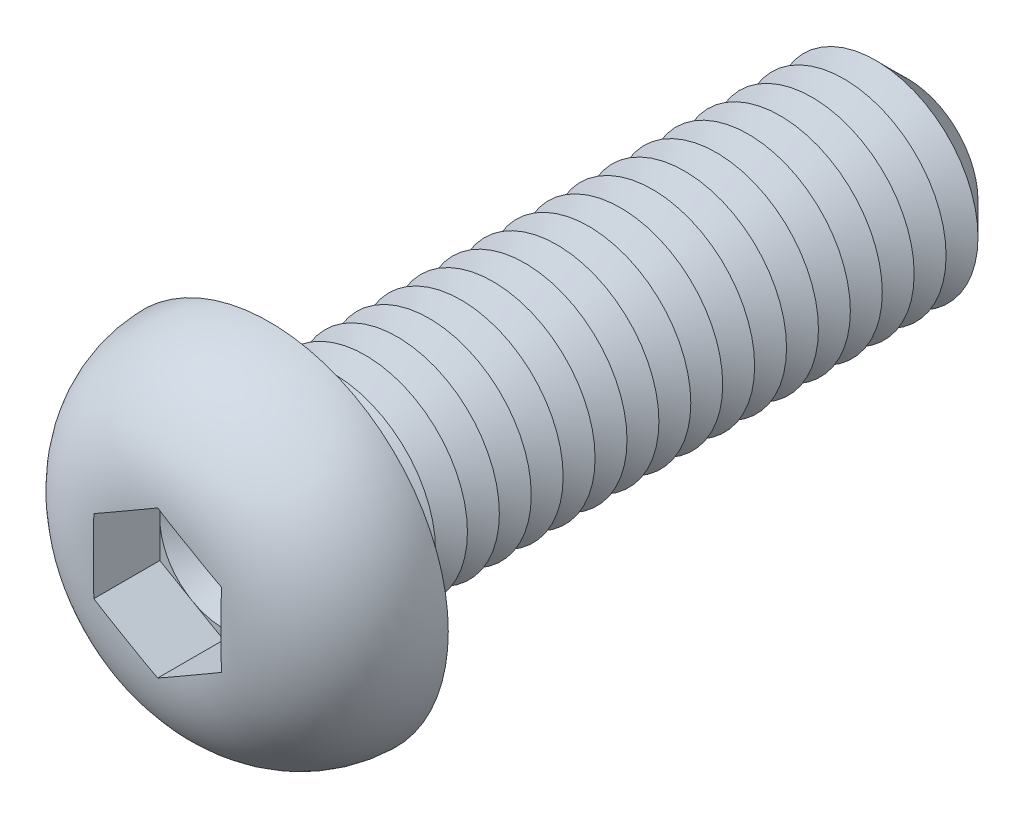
ISO-10303-21;
HEADER;
FILE_DESCRIPTION(('STEP AP214'),'2;1');
FILE_NAME('part.step','',(''),(''),'','','');
FILE_SCHEMA(('AUTOMOTIVE_DESIGN { 1 0 10303 214 1 1 1 1 }'));
ENDSEC;
DATA;
#1=APPLICATION_CONTEXT('core data for automotive mechanical design processes');
#2=APPLICATION_PROTOCOL_DEFINITION('international standard','automotive_design',2000,#1);
#3=PRODUCT_CONTEXT('',#1,'mechanical');
#4=PRODUCT('Part','Part','',(#3));
#5=PRODUCT_RELATED_PRODUCT_CATEGORY('part','',(#4));
#6=PRODUCT_DEFINITION_FORMATION('','',#4);
#7=PRODUCT_DEFINITION_CONTEXT('part definition',#1,'design');
#8=PRODUCT_DEFINITION('design','',#6,#7);
#9=PRODUCT_DEFINITION_SHAPE('','',#8);
#10=(LENGTH_UNIT() NAMED_UNIT(*) SI_UNIT(.MILLI.,.METRE.));
#11=(NAMED_UNIT(*) PLANE_ANGLE_UNIT() SI_UNIT($,.RADIAN.));
#12=(NAMED_UNIT(*) SI_UNIT($,.STERADIAN.) SOLID_ANGLE_UNIT());
#13=UNCERTAINTY_MEASURE_WITH_UNIT(LENGTH_MEASURE(1.E-05),#10,'distance_accuracy_value','');
#14=(GEOMETRIC_REPRESENTATION_CONTEXT(3) GLOBAL_UNCERTAINTY_ASSIGNED_CONTEXT((#13)) GLOBAL_UNIT_ASSIGNED_CONTEXT((#10,
#11,#12)) REPRESENTATION_CONTEXT('',''));
#15=CARTESIAN_POINT('',(0.,0.,0.));
#16=DIRECTION('',(0.,0.,1.));
#17=DIRECTION('',(1.,0.,0.));
#18=AXIS2_PLACEMENT_3D('',#15,#16,#17);
#19=CARTESIAN_POINT('',(0.,0.,1.8));
#20=DIRECTION('',(0.,0.,1.));
#21=DIRECTION('',(1.,0.,0.));
#22=AXIS2_PLACEMENT_3D('',#19,#20,#21);
#23=PLANE('',#22);
#24=CARTESIAN_POINT('',(0.,0.,1.8));
#25=DIRECTION('',(0.,0.,1.));
#26=DIRECTION('',(1.,0.,0.));
#27=AXIS2_PLACEMENT_3D('',#24,#25,#26);
#28=CIRCLE('',#27,2.5);
#29=CARTESIAN_POINT('',(2.5,0.,1.8));
#30=VERTEX_POINT('',#29);
#31=CARTESIAN_POINT('',(1.25,2.1650635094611,1.8));
#32=VERTEX_POINT('',#31);
#33=EDGE_CURVE('E153',#30,#32,#28,.T.);
#34=ORIENTED_EDGE('',*,*,#33,.F.);
#35=DIRECTION('',(0.,1.,0.));
#36=VECTOR('',#35,1.);
#37=CARTESIAN_POINT('',(2.5,-1.44337567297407,1.8));
#38=LINE('',#37,#36);
#39=CARTESIAN_POINT('',(2.5,1.44337567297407,1.8));
#40=VERTEX_POINT('',#39);
#41=EDGE_CURVE('E176',#30,#40,#38,.T.);
#42=ORIENTED_EDGE('',*,*,#41,.T.);
#43=DIRECTION('',(-0.866025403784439,0.5,0.));
#44=VECTOR('',#43,1.);
#45=CARTESIAN_POINT('',(2.5,1.44337567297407,1.8));
#46=LINE('',#45,#44);
#47=EDGE_CURVE('E172',#40,#32,#46,.T.);
#48=ORIENTED_EDGE('',*,*,#47,.T.);
#49=EDGE_LOOP('',(#34,#42,#48));
#50=FACE_BOUND('',#49,.T.);
#51=ADVANCED_FACE('F39',(#50),#23,.T.);
#52=CARTESIAN_POINT('',(0.,0.,1.8));
#53=DIRECTION('',(0.,0.,1.));
#54=DIRECTION('',(1.,0.,0.));
#55=AXIS2_PLACEMENT_3D('',#52,#53,#54);
#56=CIRCLE('',#55,2.5);
#57=CARTESIAN_POINT('',(-1.25,2.1650635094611,1.8));
#58=VERTEX_POINT('',#57);
#59=EDGE_CURVE('E11',#32,#58,#56,.T.);
#60=ORIENTED_EDGE('',*,*,#59,.F.);
#61=CARTESIAN_POINT('',(0.,2.88675134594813,1.8));
#62=VERTEX_POINT('',#61);
#63=EDGE_CURVE('E166',#32,#62,#46,.T.);
#64=ORIENTED_EDGE('',*,*,#63,.T.);
#65=DIRECTION('',(-0.866025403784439,-0.5,0.));
#66=VECTOR('',#65,1.);
#67=CARTESIAN_POINT('',(0.,2.88675134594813,1.8));
#68=LINE('',#67,#66);
#69=EDGE_CURVE('E167',#62,#58,#68,.T.);
#70=ORIENTED_EDGE('',*,*,#69,.T.);
#71=EDGE_LOOP('',(#60,#64,#70));
#72=FACE_BOUND('',#71,.T.);
#73=ADVANCED_FACE('F165',(#72),#23,.T.);
#74=CARTESIAN_POINT('',(-2.5,0.,1.8));
#75=VERTEX_POINT('',#74);
#76=EDGE_CURVE('E49',#58,#75,#56,.T.);
#77=ORIENTED_EDGE('',*,*,#76,.F.);
#78=CARTESIAN_POINT('',(-2.5,1.44337567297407,1.8));
#79=VERTEX_POINT('',#78);
#80=EDGE_CURVE('E179',#58,#79,#68,.T.);
#81=ORIENTED_EDGE('',*,*,#80,.T.);
#82=DIRECTION('',(0.,-1.,0.));
#83=VECTOR('',#82,1.);
#84=CARTESIAN_POINT('',(-2.5,1.44337567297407,1.8));
#85=LINE('',#84,#83);
#86=EDGE_CURVE('E190',#79,#75,#85,.T.);
#87=ORIENTED_EDGE('',*,*,#86,.T.);
#88=EDGE_LOOP('',(#77,#81,#87));
#89=FACE_BOUND('',#88,.T.);
#90=ADVANCED_FACE('F441',(#89),#23,.T.);
#91=CARTESIAN_POINT('',(-1.25,-2.1650635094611,1.8));
#92=VERTEX_POINT('',#91);
#93=EDGE_CURVE('E424',#75,#92,#56,.T.);
#94=ORIENTED_EDGE('',*,*,#93,.F.);
#95=CARTESIAN_POINT('',(-2.5,-1.44337567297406,1.8));
#96=VERTEX_POINT('',#95);
#97=EDGE_CURVE('E189',#75,#96,#85,.T.);
#98=ORIENTED_EDGE('',*,*,#97,.T.);
#99=DIRECTION('',(0.866025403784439,-0.5,0.));
#100=VECTOR('',#99,1.);
#101=CARTESIAN_POINT('',(-2.5,-1.44337567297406,1.8));
#102=LINE('',#101,#100);
#103=EDGE_CURVE('E195',#96,#92,#102,.T.);
#104=ORIENTED_EDGE('',*,*,#103,.T.);
#105=EDGE_LOOP('',(#94,#98,#104));
#106=FACE_BOUND('',#105,.T.);
#107=ADVANCED_FACE('F435',(#106),#23,.T.);
#108=CARTESIAN_POINT('',(1.25,-2.1650635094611,1.8));
#109=VERTEX_POINT('',#108);
#110=EDGE_CURVE('E56',#92,#109,#56,.T.);
#111=ORIENTED_EDGE('',*,*,#110,.F.);
#112=CARTESIAN_POINT('',(0.,-2.88675134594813,1.8));
#113=VERTEX_POINT('',#112);
#114=EDGE_CURVE('E194',#92,#113,#102,.T.);
#115=ORIENTED_EDGE('',*,*,#114,.T.);
#116=DIRECTION('',(0.866025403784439,0.5,0.));
#117=VECTOR('',#116,1.);
#118=CARTESIAN_POINT('',(0.,-2.88675134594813,1.8));
#119=LINE('',#118,#117);
#120=EDGE_CURVE('E200',#113,#109,#119,.T.);
#121=ORIENTED_EDGE('',*,*,#120,.T.);
#122=EDGE_LOOP('',(#111,#115,#121));
#123=FACE_BOUND('',#122,.T.);
#124=ADVANCED_FACE('F476',(#123),#23,.T.);
#125=CARTESIAN_POINT('',(0.,0.,-25.));
#126=DIRECTION('',(0.,0.,1.));
#127=DIRECTION('',(1.,0.,0.));
#128=AXIS2_PLACEMENT_3D('',#125,#126,#127);
#129=CYLINDRICAL_SURFACE('',#128,4.);
#130=CARTESIAN_POINT('',(0.,0.,-0.5));
#131=DIRECTION('',(0.,0.,1.));
#132=DIRECTION('',(1.,0.,0.));
#133=AXIS2_PLACEMENT_3D('',#130,#131,#132);
#134=CIRCLE('',#133,4.);
#135=CARTESIAN_POINT('',(4.,0.,-0.5));
#136=VERTEX_POINT('',#135);
#137=EDGE_CURVE('E411',#136,#136,#134,.F.);
#138=ORIENTED_EDGE('',*,*,#137,.T.);
#139=EDGE_LOOP('',(#138));
#140=FACE_BOUND('',#139,.T.);
#141=CARTESIAN_POINT('',(0.,0.,-1.25));
#142=DIRECTION('',(0.,0.,1.));
#143=DIRECTION('',(1.,0.,0.));
#144=AXIS2_PLACEMENT_3D('',#141,#142,#143);
#145=CIRCLE('',#144,4.00000000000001);
#146=CARTESIAN_POINT('',(4.00000000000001,0.,-1.25));
#147=VERTEX_POINT('',#146);
#148=EDGE_CURVE('E185',#147,#147,#145,.T.);
#149=ORIENTED_EDGE('',*,*,#148,.T.);
#150=EDGE_LOOP('',(#149));
#151=FACE_BOUND('',#150,.T.);
#152=ADVANCED_FACE('F471',(#140,#151),#129,.T.);
#153=CARTESIAN_POINT('',(0.,7.,0.));
#154=DIRECTION('',(0.,0.,1.));
#155=DIRECTION('',(1.,0.,0.));
#156=AXIS2_PLACEMENT_3D('',#153,#154,#155);
#157=PLANE('',#156);
#158=CARTESIAN_POINT('',(0.,0.,0.));
#159=DIRECTION('',(0.,0.,1.));
#160=DIRECTION('',(1.,0.,0.));
#161=AXIS2_PLACEMENT_3D('',#158,#159,#160);
#162=CIRCLE('',#161,4.5);
#163=CARTESIAN_POINT('',(4.5,0.,0.));
#164=VERTEX_POINT('',#163);
#165=EDGE_CURVE('E414',#164,#164,#162,.T.);
#166=ORIENTED_EDGE('',*,*,#165,.T.);
#167=EDGE_LOOP('',(#166));
#168=FACE_BOUND('',#167,.T.);
#169=CARTESIAN_POINT('',(0.,0.,0.));
#170=DIRECTION('',(0.,0.,1.));
#171=DIRECTION('',(1.,0.,0.));
#172=AXIS2_PLACEMENT_3D('',#169,#170,#171);
#173=CIRCLE('',#172,7.);
#174=CARTESIAN_POINT('',(7.,0.,0.));
#175=VERTEX_POINT('',#174);
#176=EDGE_CURVE('E211',#175,#175,#173,.T.);
#177=ORIENTED_EDGE('',*,*,#176,.F.);
#178=EDGE_LOOP('',(#177));
#179=FACE_BOUND('',#178,.T.);
#180=ADVANCED_FACE('F469',(#168,#179),#157,.F.);
#181=CARTESIAN_POINT('',(0.,0.,-0.1));
#182=DIRECTION('',(0.,0.,1.));
#183=DIRECTION('',(1.,0.,0.));
#184=AXIS2_PLACEMENT_3D('',#181,#182,#183);
#185=DEGENERATE_TOROIDAL_SURFACE('',#184,2.5011112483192,4.5,.T.);
#186=CARTESIAN_POINT('',(1.31456088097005,2.12778926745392,4.4));
#187=DIRECTION('',(-0.866025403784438,0.500000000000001,0.));
#188=VECTOR('',#187,1.);
#189=LINE('',#186,#188);
#190=CARTESIAN_POINT('',(1.31456088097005,2.12778926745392,4.4));
#191=VERTEX_POINT('',#190);
#192=CARTESIAN_POINT('',(1.18543911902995,2.20233775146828,4.4));
#193=VERTEX_POINT('',#192);
#194=EDGE_CURVE('E399',#191,#193,#189,.T.);
#195=ORIENTED_EDGE('',*,*,#194,.F.);
#196=CARTESIAN_POINT('',(-0.000200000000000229,2.88686681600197,4.38343536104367));
#197=CARTESIAN_POINT('',(0.103935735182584,2.82674402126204,4.38859262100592));
#198=CARTESIAN_POINT('',(0.208111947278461,2.76659785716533,4.39207570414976));
#199=CARTESIAN_POINT('',(0.416486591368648,2.64629270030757,4.39683754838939));
#200=CARTESIAN_POINT('',(0.520685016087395,2.58613371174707,4.39811670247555));
#201=CARTESIAN_POINT('',(0.729066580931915,2.46582455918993,4.3996156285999));
#202=CARTESIAN_POINT('',(0.833249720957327,2.40567439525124,4.39983556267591));
#203=CARTESIAN_POINT('',(1.04162190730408,2.2853706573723,4.4000276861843));
#204=CARTESIAN_POINT('',(1.14581095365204,2.2252170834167,4.39999986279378));
#205=CARTESIAN_POINT('',(1.35418904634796,2.10490993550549,4.39999986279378));
#206=CARTESIAN_POINT('',(1.45837809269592,2.04475636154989,4.4000276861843));
#207=CARTESIAN_POINT('',(1.66675027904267,1.92445262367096,4.39983556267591));
#208=CARTESIAN_POINT('',(1.77093341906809,1.86430245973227,4.3996156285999));
#209=CARTESIAN_POINT('',(1.97931498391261,1.74399330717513,4.39811670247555));
#210=CARTESIAN_POINT('',(2.08351340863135,1.68383431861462,4.39683754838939));
#211=CARTESIAN_POINT('',(2.29188805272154,1.56352916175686,4.39207570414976));
#212=CARTESIAN_POINT('',(2.39606426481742,1.50338299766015,4.38859262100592));
#213=CARTESIAN_POINT('',(2.5002,1.44326020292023,4.38343536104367));
#214=B_SPLINE_CURVE_WITH_KNOTS('',3,(#196,#197,#198,#199,#200,#201,#202,#203,#204,#205,#206,
#207,#208,#209,#210,#211,#212,#213),.UNSPECIFIED.,.F.,.F.,(4,2,2,2,2,2,2,2,4),(0.,
0.361022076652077,0.721979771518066,1.08288224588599,1.44380339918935,1.80472455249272,
2.16562702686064,2.52658472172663,2.88760679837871),.UNSPECIFIED.);
#215=CARTESIAN_POINT('',(2.5,1.44337567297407,4.38344529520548));
#216=VERTEX_POINT('',#215);
#217=EDGE_CURVE('E355',#191,#216,#214,.T.);
#218=ORIENTED_EDGE('',*,*,#217,.T.);
#219=CARTESIAN_POINT('',(2.5,0.,4.39999986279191));
#220=CARTESIAN_POINT('',(2.5,-0.104697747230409,4.39999811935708));
#221=CARTESIAN_POINT('',(2.5,-0.209395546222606,4.40001551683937));
#222=CARTESIAN_POINT('',(2.5,-0.418792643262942,4.39990807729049));
#223=CARTESIAN_POINT('',(2.5,-0.52349194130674,4.39978323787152));
#224=CARTESIAN_POINT('',(2.5,-0.732936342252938,4.39891238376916));
#225=CARTESIAN_POINT('',(2.5,-0.837681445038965,4.39816609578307));
#226=CARTESIAN_POINT('',(2.5,-1.04715282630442,4.39536239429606));
#227=CARTESIAN_POINT('',(2.5,-1.15187910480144,4.39330498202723));
#228=CARTESIAN_POINT('',(2.5,-1.46476484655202,4.38400647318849));
#229=CARTESIAN_POINT('',(2.5,-1.67286375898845,4.37365196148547));
#230=CARTESIAN_POINT('',(2.5,-2.08783281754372,4.33852954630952));
#231=CARTESIAN_POINT('',(2.5,-2.29470379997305,4.31377296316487));
#232=CARTESIAN_POINT('',(2.5,-2.64451002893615,4.25536510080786));
#233=CARTESIAN_POINT('',(2.5,-2.78823975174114,4.22651785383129));
#234=CARTESIAN_POINT('',(2.5,-3.073224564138,4.15827060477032));
#235=CARTESIAN_POINT('',(2.5,-3.21447933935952,4.11886927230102));
#236=CARTESIAN_POINT('',(2.5,-3.49353952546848,4.02870287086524));
#237=CARTESIAN_POINT('',(2.5,-3.6313402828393,3.97792330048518));
#238=CARTESIAN_POINT('',(2.5,-3.90204977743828,3.86463774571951));
#239=CARTESIAN_POINT('',(2.5,-4.0349587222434,3.8021322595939));
#240=CARTESIAN_POINT('',(2.5,-4.2956525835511,3.66474880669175));
#241=CARTESIAN_POINT('',(2.5,-4.42338586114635,3.58977252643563));
#242=CARTESIAN_POINT('',(2.5,-4.67118559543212,3.42803136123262));
#243=CARTESIAN_POINT('',(2.5,-4.79125159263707,3.3412657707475));
#244=CARTESIAN_POINT('',(2.5,-5.02233156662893,3.15645800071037));
#245=CARTESIAN_POINT('',(2.5,-5.13334771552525,3.05841854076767));
#246=CARTESIAN_POINT('',(2.5,-5.34506083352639,2.85177471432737));
#247=CARTESIAN_POINT('',(2.5,-5.44575933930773,2.74317192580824));
#248=CARTESIAN_POINT('',(2.5,-5.62335564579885,2.53102225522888));
#249=CARTESIAN_POINT('',(2.5,-5.70164721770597,2.42863868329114));
#250=CARTESIAN_POINT('',(2.5,-5.84882394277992,2.21725758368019));
#251=CARTESIAN_POINT('',(2.5,-5.91770588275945,2.10825781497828));
#252=CARTESIAN_POINT('',(2.5,-6.04532926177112,1.88460009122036));
#253=CARTESIAN_POINT('',(2.5,-6.1040794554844,1.76994713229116));
#254=CARTESIAN_POINT('',(2.5,-6.21098181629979,1.53574793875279));
#255=CARTESIAN_POINT('',(2.5,-6.25913021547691,1.41619998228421));
#256=CARTESIAN_POINT('',(2.5,-6.34173830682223,1.18065209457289));
#257=CARTESIAN_POINT('',(2.5,-6.37685491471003,1.06488207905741));
#258=CARTESIAN_POINT('',(2.5,-6.43703913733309,0.830714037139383));
#259=CARTESIAN_POINT('',(2.5,-6.46210319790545,0.712315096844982));
#260=CARTESIAN_POINT('',(2.5,-6.50194044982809,0.473848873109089));
#261=CARTESIAN_POINT('',(2.5,-6.51671856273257,0.353782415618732));
#262=CARTESIAN_POINT('',(2.5,-6.53588982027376,0.112808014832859));
#263=CARTESIAN_POINT('',(2.5,-6.54027911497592,-0.00810022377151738));
#264=CARTESIAN_POINT('',(2.5,-6.53779027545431,-0.365870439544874));
#265=CARTESIAN_POINT('',(2.5,-6.51607942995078,-0.602790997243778));
#266=CARTESIAN_POINT('',(2.5,-6.43310265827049,-1.06957107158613));
#267=CARTESIAN_POINT('',(2.5,-6.3718398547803,-1.29943114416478));
#268=CARTESIAN_POINT('',(2.5,-6.25195024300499,-1.63390601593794));
#269=CARTESIAN_POINT('',(2.5,-6.20730237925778,-1.74371189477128));
#270=CARTESIAN_POINT('',(2.5,-6.10902350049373,-1.95921136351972));
#271=CARTESIAN_POINT('',(2.5,-6.05539567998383,-2.06490639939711));
#272=CARTESIAN_POINT('',(2.5,-5.93955620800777,-2.27152527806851));
#273=CARTESIAN_POINT('',(2.5,-5.87734126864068,-2.37244727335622));
#274=CARTESIAN_POINT('',(2.5,-5.7448545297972,-2.56880727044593));
#275=CARTESIAN_POINT('',(2.5,-5.67458537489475,-2.6642470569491));
#276=CARTESIAN_POINT('',(2.5,-5.52523018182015,-2.85070592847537));
#277=CARTESIAN_POINT('',(2.5,-5.44601185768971,-2.94161901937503));
#278=CARTESIAN_POINT('',(2.5,-5.28044044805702,-3.11663859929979));
#279=CARTESIAN_POINT('',(2.5,-5.194089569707,-3.2007471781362));
#280=CARTESIAN_POINT('',(2.5,-5.01485870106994,-3.36178408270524));
#281=CARTESIAN_POINT('',(2.5,-4.92197538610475,-3.43870870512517));
#282=CARTESIAN_POINT('',(2.5,-4.73045535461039,-3.58495812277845));
#283=CARTESIAN_POINT('',(2.5,-4.6318202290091,-3.65428500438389));
#284=CARTESIAN_POINT('',(2.5,-4.4247626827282,-3.78818551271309));
#285=CARTESIAN_POINT('',(2.5,-4.31609824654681,-3.85238474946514));
#286=CARTESIAN_POINT('',(2.5,-4.0940582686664,-3.97208975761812));
#287=CARTESIAN_POINT('',(2.5,-3.98068153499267,-4.02759331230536));
#288=CARTESIAN_POINT('',(2.5,-3.75029026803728,-4.12981004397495));
#289=CARTESIAN_POINT('',(2.5,-3.63328275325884,-4.17653908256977));
#290=CARTESIAN_POINT('',(2.5,-3.39631992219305,-4.2614893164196));
#291=CARTESIAN_POINT('',(2.5,-3.27636651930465,-4.29971587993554));
#292=CARTESIAN_POINT('',(2.5,-3.00446622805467,-4.37644925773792));
#293=CARTESIAN_POINT('',(2.5,-2.85188931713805,-4.41272455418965));
#294=CARTESIAN_POINT('',(2.5,-2.54443794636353,-4.47385449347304));
#295=CARTESIAN_POINT('',(2.5,-2.3895624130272,-4.49870361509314));
#296=CARTESIAN_POINT('',(2.5,-2.07807451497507,-4.53870829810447));
#297=CARTESIAN_POINT('',(2.5,-1.92145805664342,-4.55383091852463));
#298=CARTESIAN_POINT('',(2.5,-1.60772330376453,-4.57647936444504));
#299=CARTESIAN_POINT('',(2.5,-1.45060502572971,-4.58400543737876));
#300=CARTESIAN_POINT('',(2.5,-1.13432460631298,-4.59416656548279));
#301=CARTESIAN_POINT('',(2.5,-0.975160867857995,-4.59674096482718));
#302=CARTESIAN_POINT('',(2.5,-0.656826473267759,-4.59957813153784));
#303=CARTESIAN_POINT('',(2.5,-0.497655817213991,-4.59984092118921));
#304=CARTESIAN_POINT('',(2.5,-0.179547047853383,-4.60005428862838));
#305=CARTESIAN_POINT('',(2.5,-0.02060893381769,-4.60000532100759));
#306=CARTESIAN_POINT('',(2.5,0.297265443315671,-4.59999304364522));
#307=CARTESIAN_POINT('',(2.5,0.456201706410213,-4.60002973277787));
#308=CARTESIAN_POINT('',(2.5,0.70967559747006,-4.59902611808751));
#309=CARTESIAN_POINT('',(2.5,0.804213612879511,-4.59841616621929));
#310=CARTESIAN_POINT('',(2.5,0.99327694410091,-4.59620676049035));
#311=CARTESIAN_POINT('',(2.5,1.08780225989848,-4.59460730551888));
#312=CARTESIAN_POINT('',(2.5,1.37137837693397,-4.58746770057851));
#313=CARTESIAN_POINT('',(2.5,1.56039301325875,-4.57958602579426));
#314=CARTESIAN_POINT('',(2.5,1.93609462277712,-4.55305686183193));
#315=CARTESIAN_POINT('',(2.5,2.12278756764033,-4.53450331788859));
#316=CARTESIAN_POINT('',(2.5,2.49421016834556,-4.48296248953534));
#317=CARTESIAN_POINT('',(2.5,2.67894050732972,-4.44998040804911));
#318=CARTESIAN_POINT('',(2.5,2.99962701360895,-4.37718406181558));
#319=CARTESIAN_POINT('',(2.5,3.13641465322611,-4.34103978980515));
#320=CARTESIAN_POINT('',(2.5,3.40682838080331,-4.25834226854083));
#321=CARTESIAN_POINT('',(2.5,3.54045461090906,-4.21178948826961));
#322=CARTESIAN_POINT('',(2.5,3.80387940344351,-4.1076796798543));
#323=CARTESIAN_POINT('',(2.5,3.93366385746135,-4.05008679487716));
#324=CARTESIAN_POINT('',(2.5,4.18776789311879,-3.92385886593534));
#325=CARTESIAN_POINT('',(2.5,4.31208736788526,-3.85522360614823));
#326=CARTESIAN_POINT('',(2.5,4.55475418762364,-3.70660227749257));
#327=CARTESIAN_POINT('',(2.5,4.67306276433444,-3.62655275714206));
#328=CARTESIAN_POINT('',(2.5,4.90171316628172,-3.45576294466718));
#329=CARTESIAN_POINT('',(2.5,5.01205476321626,-3.36502234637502));
#330=CARTESIAN_POINT('',(2.5,5.22347091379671,-3.17353376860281));
#331=CARTESIAN_POINT('',(2.5,5.32455555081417,-3.07279693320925));
#332=CARTESIAN_POINT('',(2.5,5.51647993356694,-2.86200023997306));
#333=CARTESIAN_POINT('',(2.5,5.6073208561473,-2.75194145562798));
#334=CARTESIAN_POINT('',(2.5,5.76832451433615,-2.53607083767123));
#335=CARTESIAN_POINT('',(2.5,5.83966300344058,-2.4311337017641));
#336=CARTESIAN_POINT('',(2.5,5.97282702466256,-2.2153291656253));
#337=CARTESIAN_POINT('',(2.5,6.03464926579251,-2.10445973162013));
#338=CARTESIAN_POINT('',(2.5,6.14815657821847,-1.87771731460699));
#339=CARTESIAN_POINT('',(2.5,6.19984675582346,-1.76184688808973));
#340=CARTESIAN_POINT('',(2.5,6.29267395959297,-1.52590109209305));
#341=CARTESIAN_POINT('',(2.5,6.33380720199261,-1.40582423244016));
#342=CARTESIAN_POINT('',(2.5,6.40328888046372,-1.16869740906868));
#343=CARTESIAN_POINT('',(2.5,6.43218419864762,-1.05180738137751));
#344=CARTESIAN_POINT('',(2.5,6.47988151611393,-0.815941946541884));
#345=CARTESIAN_POINT('',(2.5,6.49867991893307,-0.696965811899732));
#346=CARTESIAN_POINT('',(2.5,6.52599950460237,-0.457898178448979));
#347=CARTESIAN_POINT('',(2.5,6.53452634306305,-0.337807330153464));
#348=CARTESIAN_POINT('',(2.5,6.54126106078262,-0.0973214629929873));
#349=CARTESIAN_POINT('',(2.5,6.5394651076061,0.023073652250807));
#350=CARTESIAN_POINT('',(2.5,6.51879545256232,0.379398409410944));
#351=CARTESIAN_POINT('',(2.5,6.48510560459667,0.614630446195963));
#352=CARTESIAN_POINT('',(2.5,6.37872360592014,1.07608887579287));
#353=CARTESIAN_POINT('',(2.5,6.30603128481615,1.3023152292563));
#354=CARTESIAN_POINT('',(2.5,6.16957161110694,1.63028303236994));
#355=CARTESIAN_POINT('',(2.5,6.11941470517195,1.7378698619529));
#356=CARTESIAN_POINT('',(2.5,6.01034124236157,1.94849153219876));
#357=CARTESIAN_POINT('',(2.5,5.9514277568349,2.05152795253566));
#358=CARTESIAN_POINT('',(2.5,5.82528890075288,2.25240256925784));
#359=CARTESIAN_POINT('',(2.5,5.75806159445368,2.35023954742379));
#360=CARTESIAN_POINT('',(2.5,5.61585543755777,2.54005689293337));
#361=CARTESIAN_POINT('',(2.5,5.54087908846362,2.63203913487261));
#362=CARTESIAN_POINT('',(2.5,5.38212190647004,2.81146438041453));
#363=CARTESIAN_POINT('',(2.5,5.29819182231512,2.89877528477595));
#364=CARTESIAN_POINT('',(2.5,5.12353712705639,3.06625194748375));
#365=CARTESIAN_POINT('',(2.5,5.03281455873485,3.14641983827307));
#366=CARTESIAN_POINT('',(2.5,4.84518171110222,3.29930665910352));
#367=CARTESIAN_POINT('',(2.5,4.74826657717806,3.37201962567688));
#368=CARTESIAN_POINT('',(2.5,4.54907485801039,3.50961479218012));
#369=CARTESIAN_POINT('',(2.5,4.44679969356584,3.57449905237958));
#370=CARTESIAN_POINT('',(2.5,4.23202545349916,3.69953578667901));
#371=CARTESIAN_POINT('',(2.5,4.11927203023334,3.75925114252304));
#372=CARTESIAN_POINT('',(2.5,3.88947986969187,3.86977617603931));
#373=CARTESIAN_POINT('',(2.5,3.77244067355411,3.92058489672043));
#374=CARTESIAN_POINT('',(2.5,3.5351804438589,4.0133148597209));
#375=CARTESIAN_POINT('',(2.5,3.41496637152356,4.0552539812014));
#376=CARTESIAN_POINT('',(2.5,3.17195278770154,4.13067246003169));
#377=CARTESIAN_POINT('',(2.5,3.04915378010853,4.16415344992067));
#378=CARTESIAN_POINT('',(2.5,2.80683027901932,4.22194717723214));
#379=CARTESIAN_POINT('',(2.5,2.68738216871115,4.2465834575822));
#380=CARTESIAN_POINT('',(2.5,2.44729214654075,4.28920746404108));
#381=CARTESIAN_POINT('',(2.5,2.32664997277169,4.30719369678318));
#382=CARTESIAN_POINT('',(2.5,2.08450864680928,4.33736171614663));
#383=CARTESIAN_POINT('',(2.5,1.9630086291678,4.3495363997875));
#384=CARTESIAN_POINT('',(2.5,1.71961501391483,4.36908103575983));
#385=CARTESIAN_POINT('',(2.5,1.59772134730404,4.37645009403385));
#386=CARTESIAN_POINT('',(2.5,1.35283283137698,4.38761579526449));
#387=CARTESIAN_POINT('',(2.5,1.22983679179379,4.39138420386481));
#388=CARTESIAN_POINT('',(2.5,0.983808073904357,4.3965493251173));
#389=CARTESIAN_POINT('',(2.5,0.860775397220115,4.3979461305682));
#390=CARTESIAN_POINT('',(2.5,0.614783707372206,4.39958107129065));
#391=CARTESIAN_POINT('',(2.5,0.491824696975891,4.3998199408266));
#392=CARTESIAN_POINT('',(2.5,0.245910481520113,4.40003035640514));
#393=CARTESIAN_POINT('',(2.5,0.122955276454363,4.4000019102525));
#394=CARTESIAN_POINT('',(2.5,0.,4.39999986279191));
#395=B_SPLINE_CURVE_WITH_KNOTS('',3,(#219,#220,#221,#222,#223,#224,#225,#226,#227,#228,#229,
#230,#231,#232,#233,#234,#235,#236,#237,#238,#239,#240,#241,#242,#243,#244,#245,#246,#247,#248,
#249,#250,#251,#252,#253,#254,#255,#256,#257,#258,#259,#260,#261,#262,#263,#264,#265,#266,#267,
#268,#269,#270,#271,#272,#273,#274,#275,#276,#277,#278,#279,#280,#281,#282,#283,#284,#285,#286,
#287,#288,#289,#290,#291,#292,#293,#294,#295,#296,#297,#298,#299,#300,#301,#302,#303,#304,#305,
#306,#307,#308,#309,#310,#311,#312,#313,#314,#315,#316,#317,#318,#319,#320,#321,#322,#323,#324,
#325,#326,#327,#328,#329,#330,#331,#332,#333,#334,#335,#336,#337,#338,#339,#340,#341,#342,#343,
#344,#345,#346,#347,#348,#349,#350,#351,#352,#353,#354,#355,#356,#357,#358,#359,#360,#361,#362,
#363,#364,#365,#366,#367,#368,#369,#370,#371,#372,#373,#374,#375,#376,#377,#378,#379,#380,#381,
#382,#383,#384,#385,#386,#387,#388,#389,#390,#391,#392,#393,#394),.UNSPECIFIED.,.T.,.F.,(4,2,2,
2,2,2,2,2,2,2,2,2,2,2,2,2,2,2,2,2,2,2,2,2,2,2,2,2,2,2,2,2,2,2,2,2,2,2,2,2,2,2,2,2,2,2,2,2,2,2,2,
2,2,2,2,2,2,2,2,2,2,2,2,2,2,2,2,2,2,2,2,2,2,2,2,2,2,2,2,2,2,2,2,2,2,2,2,4),(0.,
0.314093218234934,0.62819170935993,0.942428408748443,1.25666481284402,1.88144147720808,
2.50572771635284,2.94516878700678,3.38466527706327,3.82472511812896,4.26476626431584,
4.70845695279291,5.15217420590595,5.59578464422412,6.03932891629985,6.42549664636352,
6.81179591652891,7.19775970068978,7.58386043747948,7.94635637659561,8.30898036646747,
8.67143073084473,9.03401539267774,9.74414367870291,10.4542159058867,10.8094792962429,
11.1646165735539,11.5198902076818,11.8750475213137,12.2363927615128,12.597626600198,
12.9590456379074,13.3203651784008,13.698597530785,14.0769261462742,14.4545641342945,
14.8319630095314,15.3019396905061,15.7721432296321,16.2439309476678,16.715703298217,
17.1932187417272,17.6707295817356,18.1475442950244,18.6243527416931,18.9079682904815,
19.1915841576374,19.7589248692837,20.3213460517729,20.8835645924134,21.3076400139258,
21.731696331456,22.1571540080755,22.5826200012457,23.0105507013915,23.4384936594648,
23.8659647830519,24.2933867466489,24.6735755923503,25.0538956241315,25.4340234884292,
25.8142874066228,26.1750761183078,26.5359932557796,26.8967115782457,27.2575638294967,
27.9668653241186,28.6761699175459,29.0319382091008,29.3875820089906,29.7433087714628,
30.0989210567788,30.4618400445,30.8246503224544,31.1877485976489,31.5507511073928,
31.9331198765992,32.3155297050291,32.6971611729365,33.0787189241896,33.4443988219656,
33.8101607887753,34.1763686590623,34.54264464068,34.9117697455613,35.2808804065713,
35.6497569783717,36.0186227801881),.UNSPECIFIED.);
#396=CARTESIAN_POINT('',(2.5,0.0745484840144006,4.4));
#397=VERTEX_POINT('',#396);
#398=EDGE_CURVE('E345',#216,#397,#395,.T.);
#399=ORIENTED_EDGE('',*,*,#398,.T.);
#400=CARTESIAN_POINT('',(2.5,-0.0745484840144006,4.4));
#401=DIRECTION('',(0.,1.,0.));
#402=VECTOR('',#401,1.);
#403=LINE('',#400,#402);
#404=CARTESIAN_POINT('',(2.5,-0.0745484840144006,4.4));
#405=VERTEX_POINT('',#404);
#406=EDGE_CURVE('E174',#405,#397,#403,.T.);
#407=ORIENTED_EDGE('',*,*,#406,.F.);
#408=CARTESIAN_POINT('',(2.5,-1.44337567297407,4.38344529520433));
#409=VERTEX_POINT('',#408);
#410=EDGE_CURVE('E356',#405,#409,#395,.T.);
#411=ORIENTED_EDGE('',*,*,#410,.T.);
#412=CARTESIAN_POINT('',(2.5002,-1.44326020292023,4.38343536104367));
#413=CARTESIAN_POINT('',(2.39606426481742,-1.50338299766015,4.38859262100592));
#414=CARTESIAN_POINT('',(2.29188805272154,-1.56352916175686,4.39207570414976));
#415=CARTESIAN_POINT('',(2.08351340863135,-1.68383431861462,4.39683754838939));
#416=CARTESIAN_POINT('',(1.9793149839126,-1.74399330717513,4.39811670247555));
#417=CARTESIAN_POINT('',(1.77093341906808,-1.86430245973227,4.3996156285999));
#418=CARTESIAN_POINT('',(1.66675027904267,-1.92445262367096,4.39983556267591));
#419=CARTESIAN_POINT('',(1.45837809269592,-2.04475636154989,4.4000276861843));
#420=CARTESIAN_POINT('',(1.35418904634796,-2.10490993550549,4.39999986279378));
#421=CARTESIAN_POINT('',(1.14581095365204,-2.2252170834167,4.39999986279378));
#422=CARTESIAN_POINT('',(1.04162190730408,-2.2853706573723,4.4000276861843));
#423=CARTESIAN_POINT('',(0.833249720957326,-2.40567439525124,4.39983556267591));
#424=CARTESIAN_POINT('',(0.729066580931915,-2.46582455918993,4.3996156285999));
#425=CARTESIAN_POINT('',(0.520685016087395,-2.58613371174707,4.39811670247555));
#426=CARTESIAN_POINT('',(0.416486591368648,-2.64629270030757,4.39683754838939));
#427=CARTESIAN_POINT('',(0.208111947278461,-2.76659785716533,4.39207570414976));
#428=CARTESIAN_POINT('',(0.103935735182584,-2.82674402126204,4.38859262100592));
#429=CARTESIAN_POINT('',(-0.000200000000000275,-2.88686681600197,4.38343536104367));
#430=B_SPLINE_CURVE_WITH_KNOTS('',3,(#412,#413,#414,#415,#416,#417,#418,#419,#420,#421,#422,
#423,#424,#425,#426,#427,#428,#429),.UNSPECIFIED.,.F.,.F.,(4,2,2,2,2,2,2,2,4),(0.,
0.361022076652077,0.721979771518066,1.08288224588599,1.44380339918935,1.80472455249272,
2.16562702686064,2.52658472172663,2.88760679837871),.UNSPECIFIED.);
#431=CARTESIAN_POINT('',(1.31456088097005,-2.12778926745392,4.4));
#432=VERTEX_POINT('',#431);
#433=EDGE_CURVE('E332',#409,#432,#430,.T.);
#434=ORIENTED_EDGE('',*,*,#433,.T.);
#435=CARTESIAN_POINT('',(1.18543911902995,-2.20233775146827,4.4));
#436=DIRECTION('',(0.866025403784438,0.500000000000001,0.));
#437=VECTOR('',#436,1.);
#438=LINE('',#435,#437);
#439=CARTESIAN_POINT('',(1.18543911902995,-2.20233775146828,4.4));
#440=VERTEX_POINT('',#439);
#441=EDGE_CURVE('E341',#440,#432,#438,.T.);
#442=ORIENTED_EDGE('',*,*,#441,.F.);
#443=CARTESIAN_POINT('',(0.,-2.88675134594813,4.38344529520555));
#444=VERTEX_POINT('',#443);
#445=EDGE_CURVE('E295',#440,#444,#430,.T.);
#446=ORIENTED_EDGE('',*,*,#445,.T.);
#447=CARTESIAN_POINT('',(0.00019999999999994,-2.88686681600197,4.38343536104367));
#448=CARTESIAN_POINT('',(-0.103935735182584,-2.82674402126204,4.38859262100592));
#449=CARTESIAN_POINT('',(-0.208111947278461,-2.76659785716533,4.39207570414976));
#450=CARTESIAN_POINT('',(-0.416486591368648,-2.64629270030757,4.39683754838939));
#451=CARTESIAN_POINT('',(-0.520685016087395,-2.58613371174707,4.39811670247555));
#452=CARTESIAN_POINT('',(-0.729066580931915,-2.46582455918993,4.3996156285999));
#453=CARTESIAN_POINT('',(-0.833249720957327,-2.40567439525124,4.39983556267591));
#454=CARTESIAN_POINT('',(-1.04162190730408,-2.2853706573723,4.4000276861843));
#455=CARTESIAN_POINT('',(-1.14581095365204,-2.2252170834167,4.39999986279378));
#456=CARTESIAN_POINT('',(-1.35418904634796,-2.10490993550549,4.39999986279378));
#457=CARTESIAN_POINT('',(-1.45837809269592,-2.04475636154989,4.4000276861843));
#458=CARTESIAN_POINT('',(-1.66675027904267,-1.92445262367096,4.39983556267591));
#459=CARTESIAN_POINT('',(-1.77093341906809,-1.86430245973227,4.3996156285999));
#460=CARTESIAN_POINT('',(-1.97931498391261,-1.74399330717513,4.39811670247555));
#461=CARTESIAN_POINT('',(-2.08351340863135,-1.68383431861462,4.39683754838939));
#462=CARTESIAN_POINT('',(-2.29188805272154,-1.56352916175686,4.39207570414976));
#463=CARTESIAN_POINT('',(-2.39606426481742,-1.50338299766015,4.38859262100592));
#464=CARTESIAN_POINT('',(-2.5002,-1.44326020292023,4.38343536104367));
#465=B_SPLINE_CURVE_WITH_KNOTS('',3,(#447,#448,#449,#450,#451,#452,#453,#454,#455,#456,#457,
#458,#459,#460,#461,#462,#463,#464),.UNSPECIFIED.,.F.,.F.,(4,2,2,2,2,2,2,2,4),(0.,
0.361022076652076,0.721979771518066,1.08288224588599,1.44380339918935,1.80472455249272,
2.16562702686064,2.52658472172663,2.88760679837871),.UNSPECIFIED.);
#466=CARTESIAN_POINT('',(-1.18543911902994,-2.20233775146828,4.4));
#467=VERTEX_POINT('',#466);
#468=EDGE_CURVE('E285',#444,#467,#465,.T.);
#469=ORIENTED_EDGE('',*,*,#468,.T.);
#470=CARTESIAN_POINT('',(-1.31456088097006,-2.12778926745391,4.4));
#471=DIRECTION('',(0.86602540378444,-0.499999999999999,0.));
#472=VECTOR('',#471,1.);
#473=LINE('',#470,#472);
#474=CARTESIAN_POINT('',(-1.31456088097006,-2.12778926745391,4.4));
#475=VERTEX_POINT('',#474);
#476=EDGE_CURVE('E610',#475,#467,#473,.T.);
#477=ORIENTED_EDGE('',*,*,#476,.F.);
#478=CARTESIAN_POINT('',(-2.5,-1.44337567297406,4.38344529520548));
#479=VERTEX_POINT('',#478);
#480=EDGE_CURVE('E296',#475,#479,#465,.T.);
#481=ORIENTED_EDGE('',*,*,#480,.T.);
#482=CARTESIAN_POINT('',(-2.5,0.,4.39999986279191));
#483=CARTESIAN_POINT('',(-2.5,0.104697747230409,4.39999811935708));
#484=CARTESIAN_POINT('',(-2.5,0.209395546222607,4.40001551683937));
#485=CARTESIAN_POINT('',(-2.5,0.418792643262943,4.39990807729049));
#486=CARTESIAN_POINT('',(-2.5,0.523491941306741,4.39978323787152));
#487=CARTESIAN_POINT('',(-2.5,0.732936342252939,4.39891238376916));
#488=CARTESIAN_POINT('',(-2.5,0.837681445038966,4.39816609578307));
#489=CARTESIAN_POINT('',(-2.5,1.04715282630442,4.39536239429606));
#490=CARTESIAN_POINT('',(-2.5,1.15187910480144,4.39330498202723));
#491=CARTESIAN_POINT('',(-2.5,1.46476484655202,4.38400647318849));
#492=CARTESIAN_POINT('',(-2.5,1.67286375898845,4.37365196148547));
#493=CARTESIAN_POINT('',(-2.5,2.08783281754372,4.33852954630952));
#494=CARTESIAN_POINT('',(-2.5,2.29470379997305,4.31377296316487));
#495=CARTESIAN_POINT('',(-2.5,2.64451002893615,4.25536510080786));
#496=CARTESIAN_POINT('',(-2.5,2.78823975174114,4.22651785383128));
#497=CARTESIAN_POINT('',(-2.5,3.073224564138,4.15827060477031));
#498=CARTESIAN_POINT('',(-2.5,3.21447933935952,4.11886927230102));
#499=CARTESIAN_POINT('',(-2.5,3.49353952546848,4.02870287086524));
#500=CARTESIAN_POINT('',(-2.5,3.6313402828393,3.97792330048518));
#501=CARTESIAN_POINT('',(-2.5,3.90204977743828,3.8646377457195));
#502=CARTESIAN_POINT('',(-2.5,4.0349587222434,3.8021322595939));
#503=CARTESIAN_POINT('',(-2.5,4.2956525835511,3.66474880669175));
#504=CARTESIAN_POINT('',(-2.5,4.42338586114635,3.58977252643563));
#505=CARTESIAN_POINT('',(-2.5,4.67118559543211,3.42803136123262));
#506=CARTESIAN_POINT('',(-2.5,4.79125159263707,3.3412657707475));
#507=CARTESIAN_POINT('',(-2.5,5.02233156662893,3.15645800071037));
#508=CARTESIAN_POINT('',(-2.5,5.13334771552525,3.05841854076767));
#509=CARTESIAN_POINT('',(-2.5,5.34506083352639,2.85177471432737));
#510=CARTESIAN_POINT('',(-2.5,5.44575933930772,2.74317192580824));
#511=CARTESIAN_POINT('',(-2.5,5.62335564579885,2.53102225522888));
#512=CARTESIAN_POINT('',(-2.5,5.70164721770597,2.42863868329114));
#513=CARTESIAN_POINT('',(-2.5,5.84882394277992,2.21725758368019));
#514=CARTESIAN_POINT('',(-2.5,5.91770588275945,2.10825781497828));
#515=CARTESIAN_POINT('',(-2.5,6.04532926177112,1.88460009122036));
#516=CARTESIAN_POINT('',(-2.5,6.1040794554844,1.76994713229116));
#517=CARTESIAN_POINT('',(-2.5,6.21098181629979,1.53574793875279));
#518=CARTESIAN_POINT('',(-2.5,6.25913021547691,1.41619998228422));
#519=CARTESIAN_POINT('',(-2.5,6.34173830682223,1.18065209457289));
#520=CARTESIAN_POINT('',(-2.5,6.37685491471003,1.06488207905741));
#521=CARTESIAN_POINT('',(-2.5,6.43703913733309,0.830714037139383));
#522=CARTESIAN_POINT('',(-2.5,6.46210319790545,0.712315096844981));
#523=CARTESIAN_POINT('',(-2.5,6.50194044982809,0.473848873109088));
#524=CARTESIAN_POINT('',(-2.5,6.51671856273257,0.35378241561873));
#525=CARTESIAN_POINT('',(-2.5,6.53588982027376,0.112808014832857));
#526=CARTESIAN_POINT('',(-2.5,6.54027911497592,-0.00810022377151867));
#527=CARTESIAN_POINT('',(-2.5,6.53779027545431,-0.365870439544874));
#528=CARTESIAN_POINT('',(-2.5,6.51607942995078,-0.602790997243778));
#529=CARTESIAN_POINT('',(-2.5,6.43310265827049,-1.06957107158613));
#530=CARTESIAN_POINT('',(-2.5,6.3718398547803,-1.29943114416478));
#531=CARTESIAN_POINT('',(-2.5,6.25195024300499,-1.63390601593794));
#532=CARTESIAN_POINT('',(-2.5,6.20730237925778,-1.74371189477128));
#533=CARTESIAN_POINT('',(-2.5,6.10902350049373,-1.95921136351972));
#534=CARTESIAN_POINT('',(-2.5,6.05539567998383,-2.06490639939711));
#535=CARTESIAN_POINT('',(-2.5,5.93955620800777,-2.27152527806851));
#536=CARTESIAN_POINT('',(-2.5,5.87734126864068,-2.37244727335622));
#537=CARTESIAN_POINT('',(-2.5,5.7448545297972,-2.56880727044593));
#538=CARTESIAN_POINT('',(-2.5,5.67458537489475,-2.6642470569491));
#539=CARTESIAN_POINT('',(-2.5,5.52523018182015,-2.85070592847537));
#540=CARTESIAN_POINT('',(-2.5,5.44601185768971,-2.94161901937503));
#541=CARTESIAN_POINT('',(-2.5,5.28044044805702,-3.11663859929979));
#542=CARTESIAN_POINT('',(-2.5,5.194089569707,-3.2007471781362));
#543=CARTESIAN_POINT('',(-2.5,5.01485870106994,-3.36178408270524));
#544=CARTESIAN_POINT('',(-2.5,4.92197538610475,-3.43870870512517));
#545=CARTESIAN_POINT('',(-2.5,4.73045535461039,-3.58495812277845));
#546=CARTESIAN_POINT('',(-2.5,4.6318202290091,-3.65428500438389));
#547=CARTESIAN_POINT('',(-2.5,4.4247626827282,-3.78818551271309));
#548=CARTESIAN_POINT('',(-2.5,4.31609824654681,-3.85238474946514));
#549=CARTESIAN_POINT('',(-2.5,4.0940582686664,-3.97208975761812));
#550=CARTESIAN_POINT('',(-2.5,3.98068153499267,-4.02759331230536));
#551=CARTESIAN_POINT('',(-2.5,3.75029026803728,-4.12981004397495));
#552=CARTESIAN_POINT('',(-2.5,3.63328275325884,-4.17653908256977));
#553=CARTESIAN_POINT('',(-2.5,3.39631992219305,-4.2614893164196));
#554=CARTESIAN_POINT('',(-2.5,3.27636651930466,-4.29971587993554));
#555=CARTESIAN_POINT('',(-2.5,3.00446622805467,-4.37644925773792));
#556=CARTESIAN_POINT('',(-2.5,2.85188931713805,-4.41272455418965));
#557=CARTESIAN_POINT('',(-2.5,2.54443794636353,-4.47385449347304));
#558=CARTESIAN_POINT('',(-2.5,2.3895624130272,-4.49870361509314));
#559=CARTESIAN_POINT('',(-2.5,2.07807451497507,-4.53870829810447));
#560=CARTESIAN_POINT('',(-2.5,1.92145805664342,-4.55383091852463));
#561=CARTESIAN_POINT('',(-2.5,1.60772330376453,-4.57647936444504));
#562=CARTESIAN_POINT('',(-2.5,1.45060502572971,-4.58400543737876));
#563=CARTESIAN_POINT('',(-2.5,1.13432460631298,-4.59416656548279));
#564=CARTESIAN_POINT('',(-2.5,0.975160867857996,-4.59674096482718));
#565=CARTESIAN_POINT('',(-2.5,0.65682647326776,-4.59957813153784));
#566=CARTESIAN_POINT('',(-2.5,0.497655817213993,-4.59984092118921));
#567=CARTESIAN_POINT('',(-2.5,0.179547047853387,-4.60005428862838));
#568=CARTESIAN_POINT('',(-2.5,0.0206089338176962,-4.60000532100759));
#569=CARTESIAN_POINT('',(-2.5,-0.297265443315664,-4.59999304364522));
#570=CARTESIAN_POINT('',(-2.5,-0.456201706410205,-4.60002973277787));
#571=CARTESIAN_POINT('',(-2.5,-0.709675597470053,-4.59902611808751));
#572=CARTESIAN_POINT('',(-2.5,-0.804213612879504,-4.59841616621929));
#573=CARTESIAN_POINT('',(-2.5,-0.993276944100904,-4.59620676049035));
#574=CARTESIAN_POINT('',(-2.5,-1.08780225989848,-4.59460730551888));
#575=CARTESIAN_POINT('',(-2.5,-1.37137837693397,-4.58746770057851));
#576=CARTESIAN_POINT('',(-2.5,-1.56039301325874,-4.57958602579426));
#577=CARTESIAN_POINT('',(-2.5,-1.93609462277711,-4.55305686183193));
#578=CARTESIAN_POINT('',(-2.5,-2.12278756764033,-4.53450331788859));
#579=CARTESIAN_POINT('',(-2.5,-2.49421016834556,-4.48296248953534));
#580=CARTESIAN_POINT('',(-2.5,-2.67894050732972,-4.44998040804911));
#581=CARTESIAN_POINT('',(-2.5,-2.99962701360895,-4.37718406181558));
#582=CARTESIAN_POINT('',(-2.5,-3.13641465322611,-4.34103978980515));
#583=CARTESIAN_POINT('',(-2.5,-3.40682838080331,-4.25834226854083));
#584=CARTESIAN_POINT('',(-2.5,-3.54045461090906,-4.21178948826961));
#585=CARTESIAN_POINT('',(-2.5,-3.8038794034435,-4.1076796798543));
#586=CARTESIAN_POINT('',(-2.5,-3.93366385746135,-4.05008679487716));
#587=CARTESIAN_POINT('',(-2.5,-4.18776789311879,-3.92385886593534));
#588=CARTESIAN_POINT('',(-2.5,-4.31208736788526,-3.85522360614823));
#589=CARTESIAN_POINT('',(-2.5,-4.55475418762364,-3.70660227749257));
#590=CARTESIAN_POINT('',(-2.5,-4.67306276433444,-3.62655275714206));
#591=CARTESIAN_POINT('',(-2.5,-4.90171316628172,-3.45576294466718));
#592=CARTESIAN_POINT('',(-2.5,-5.01205476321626,-3.36502234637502));
#593=CARTESIAN_POINT('',(-2.5,-5.2234709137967,-3.17353376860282));
#594=CARTESIAN_POINT('',(-2.5,-5.32455555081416,-3.07279693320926));
#595=CARTESIAN_POINT('',(-2.5,-5.51647993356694,-2.86200023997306));
#596=CARTESIAN_POINT('',(-2.5,-5.6073208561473,-2.75194145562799));
#597=CARTESIAN_POINT('',(-2.5,-5.76832451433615,-2.53607083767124));
#598=CARTESIAN_POINT('',(-2.5,-5.83966300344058,-2.4311337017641));
#599=CARTESIAN_POINT('',(-2.5,-5.97282702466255,-2.2153291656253));
#600=CARTESIAN_POINT('',(-2.5,-6.03464926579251,-2.10445973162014));
#601=CARTESIAN_POINT('',(-2.5,-6.14815657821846,-1.877717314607));
#602=CARTESIAN_POINT('',(-2.5,-6.19984675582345,-1.76184688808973));
#603=CARTESIAN_POINT('',(-2.5,-6.29267395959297,-1.52590109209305));
#604=CARTESIAN_POINT('',(-2.5,-6.33380720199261,-1.40582423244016));
#605=CARTESIAN_POINT('',(-2.5,-6.40328888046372,-1.16869740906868));
#606=CARTESIAN_POINT('',(-2.5,-6.43218419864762,-1.05180738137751));
#607=CARTESIAN_POINT('',(-2.5,-6.47988151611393,-0.815941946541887));
#608=CARTESIAN_POINT('',(-2.5,-6.49867991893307,-0.696965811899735));
#609=CARTESIAN_POINT('',(-2.5,-6.52599950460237,-0.457898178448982));
#610=CARTESIAN_POINT('',(-2.5,-6.53452634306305,-0.337807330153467));
#611=CARTESIAN_POINT('',(-2.5,-6.54126106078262,-0.09732146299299));
#612=CARTESIAN_POINT('',(-2.5,-6.5394651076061,0.0230736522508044));
#613=CARTESIAN_POINT('',(-2.5,-6.51879545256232,0.379398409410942));
#614=CARTESIAN_POINT('',(-2.5,-6.48510560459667,0.614630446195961));
#615=CARTESIAN_POINT('',(-2.5,-6.37872360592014,1.07608887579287));
#616=CARTESIAN_POINT('',(-2.5,-6.30603128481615,1.3023152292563));
#617=CARTESIAN_POINT('',(-2.5,-6.16957161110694,1.63028303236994));
#618=CARTESIAN_POINT('',(-2.5,-6.11941470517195,1.7378698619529));
#619=CARTESIAN_POINT('',(-2.5,-6.01034124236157,1.94849153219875));
#620=CARTESIAN_POINT('',(-2.5,-5.9514277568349,2.05152795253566));
#621=CARTESIAN_POINT('',(-2.5,-5.82528890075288,2.25240256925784));
#622=CARTESIAN_POINT('',(-2.5,-5.75806159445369,2.35023954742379));
#623=CARTESIAN_POINT('',(-2.5,-5.61585543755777,2.54005689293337));
#624=CARTESIAN_POINT('',(-2.5,-5.54087908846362,2.63203913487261));
#625=CARTESIAN_POINT('',(-2.5,-5.38212190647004,2.81146438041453));
#626=CARTESIAN_POINT('',(-2.5,-5.29819182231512,2.89877528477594));
#627=CARTESIAN_POINT('',(-2.5,-5.1235371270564,3.06625194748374));
#628=CARTESIAN_POINT('',(-2.5,-5.03281455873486,3.14641983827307));
#629=CARTESIAN_POINT('',(-2.5,-4.84518171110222,3.29930665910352));
#630=CARTESIAN_POINT('',(-2.5,-4.74826657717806,3.37201962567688));
#631=CARTESIAN_POINT('',(-2.5,-4.54907485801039,3.50961479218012));
#632=CARTESIAN_POINT('',(-2.5,-4.44679969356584,3.57449905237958));
#633=CARTESIAN_POINT('',(-2.5,-4.23202545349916,3.69953578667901));
#634=CARTESIAN_POINT('',(-2.5,-4.11927203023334,3.75925114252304));
#635=CARTESIAN_POINT('',(-2.5,-3.88947986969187,3.86977617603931));
#636=CARTESIAN_POINT('',(-2.5,-3.77244067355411,3.92058489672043));
#637=CARTESIAN_POINT('',(-2.5,-3.5351804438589,4.0133148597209));
#638=CARTESIAN_POINT('',(-2.5,-3.41496637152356,4.0552539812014));
#639=CARTESIAN_POINT('',(-2.5,-3.17195278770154,4.13067246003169));
#640=CARTESIAN_POINT('',(-2.5,-3.04915378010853,4.16415344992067));
#641=CARTESIAN_POINT('',(-2.5,-2.80683027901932,4.22194717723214));
#642=CARTESIAN_POINT('',(-2.5,-2.68738216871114,4.2465834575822));
#643=CARTESIAN_POINT('',(-2.5,-2.44729214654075,4.28920746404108));
#644=CARTESIAN_POINT('',(-2.5,-2.32664997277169,4.30719369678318));
#645=CARTESIAN_POINT('',(-2.5,-2.08450864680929,4.33736171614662));
#646=CARTESIAN_POINT('',(-2.5,-1.96300862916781,4.34953639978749));
#647=CARTESIAN_POINT('',(-2.5,-1.71961501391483,4.36908103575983));
#648=CARTESIAN_POINT('',(-2.5,-1.59772134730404,4.37645009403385));
#649=CARTESIAN_POINT('',(-2.5,-1.35283283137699,4.38761579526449));
#650=CARTESIAN_POINT('',(-2.5,-1.2298367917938,4.39138420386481));
#651=CARTESIAN_POINT('',(-2.5,-0.983808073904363,4.3965493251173));
#652=CARTESIAN_POINT('',(-2.5,-0.860775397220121,4.3979461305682));
#653=CARTESIAN_POINT('',(-2.5,-0.61478370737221,4.39958107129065));
#654=CARTESIAN_POINT('',(-2.5,-0.491824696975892,4.3998199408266));
#655=CARTESIAN_POINT('',(-2.5,-0.245910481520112,4.40003035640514));
#656=CARTESIAN_POINT('',(-2.5,-0.122955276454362,4.4000019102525));
#657=CARTESIAN_POINT('',(-2.5,0.,4.39999986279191));
#658=B_SPLINE_CURVE_WITH_KNOTS('',3,(#482,#483,#484,#485,#486,#487,#488,#489,#490,#491,#492,
#493,#494,#495,#496,#497,#498,#499,#500,#501,#502,#503,#504,#505,#506,#507,#508,#509,#510,#511,
#512,#513,#514,#515,#516,#517,#518,#519,#520,#521,#522,#523,#524,#525,#526,#527,#528,#529,#530,
#531,#532,#533,#534,#535,#536,#537,#538,#539,#540,#541,#542,#543,#544,#545,#546,#547,#548,#549,
#550,#551,#552,#553,#554,#555,#556,#557,#558,#559,#560,#561,#562,#563,#564,#565,#566,#567,#568,
#569,#570,#571,#572,#573,#574,#575,#576,#577,#578,#579,#580,#581,#582,#583,#584,#585,#586,#587,
#588,#589,#590,#591,#592,#593,#594,#595,#596,#597,#598,#599,#600,#601,#602,#603,#604,#605,#606,
#607,#608,#609,#610,#611,#612,#613,#614,#615,#616,#617,#618,#619,#620,#621,#622,#623,#624,#625,
#626,#627,#628,#629,#630,#631,#632,#633,#634,#635,#636,#637,#638,#639,#640,#641,#642,#643,#644,
#645,#646,#647,#648,#649,#650,#651,#652,#653,#654,#655,#656,#657),.UNSPECIFIED.,.T.,.F.,(4,2,2,
2,2,2,2,2,2,2,2,2,2,2,2,2,2,2,2,2,2,2,2,2,2,2,2,2,2,2,2,2,2,2,2,2,2,2,2,2,2,2,2,2,2,2,2,2,2,2,2,
2,2,2,2,2,2,2,2,2,2,2,2,2,2,2,2,2,2,2,2,2,2,2,2,2,2,2,2,2,2,2,2,2,2,2,2,4),(0.,
0.314093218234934,0.62819170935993,0.942428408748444,1.25666481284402,1.88144147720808,
2.50572771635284,2.94516878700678,3.38466527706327,3.82472511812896,4.26476626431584,
4.70845695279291,5.15217420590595,5.59578464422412,6.03932891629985,6.42549664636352,
6.8117959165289,7.19775970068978,7.58386043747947,7.94635637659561,8.30898036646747,
8.67143073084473,9.03401539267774,9.74414367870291,10.4542159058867,10.8094792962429,
11.1646165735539,11.5198902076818,11.8750475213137,12.2363927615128,12.597626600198,
12.9590456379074,13.3203651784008,13.698597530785,14.0769261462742,14.4545641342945,
14.8319630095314,15.3019396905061,15.7721432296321,16.2439309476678,16.715703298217,
17.1932187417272,17.6707295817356,18.1475442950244,18.6243527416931,18.9079682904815,
19.1915841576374,19.7589248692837,20.3213460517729,20.8835645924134,21.3076400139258,
21.731696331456,22.1571540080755,22.5826200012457,23.0105507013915,23.4384936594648,
23.8659647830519,24.2933867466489,24.6735755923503,25.0538956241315,25.4340234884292,
25.8142874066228,26.1750761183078,26.5359932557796,26.8967115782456,27.2575638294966,
27.9668653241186,28.6761699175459,29.0319382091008,29.3875820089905,29.7433087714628,
30.0989210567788,30.4618400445,30.8246503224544,31.1877485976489,31.5507511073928,
31.9331198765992,32.3155297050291,32.6971611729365,33.0787189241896,33.4443988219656,
33.8101607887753,34.1763686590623,34.5426446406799,34.9117697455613,35.2808804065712,
35.6497569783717,36.0186227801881),.UNSPECIFIED.);
#659=CARTESIAN_POINT('',(-2.5,-0.0745484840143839,4.4));
#660=VERTEX_POINT('',#659);
#661=EDGE_CURVE('E269',#479,#660,#658,.T.);
#662=ORIENTED_EDGE('',*,*,#661,.T.);
#663=CARTESIAN_POINT('',(-2.5,0.0745484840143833,4.4));
#664=DIRECTION('',(0.,-1.,0.));
#665=VECTOR('',#664,1.);
#666=LINE('',#663,#665);
#667=CARTESIAN_POINT('',(-2.5,0.0745484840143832,4.4));
#668=VERTEX_POINT('',#667);
#669=EDGE_CURVE('E281',#668,#660,#666,.T.);
#670=ORIENTED_EDGE('',*,*,#669,.F.);
#671=CARTESIAN_POINT('',(-2.5,1.44337567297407,4.38344529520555));
#672=VERTEX_POINT('',#671);
#673=EDGE_CURVE('E272',#668,#672,#658,.T.);
#674=ORIENTED_EDGE('',*,*,#673,.T.);
#675=CARTESIAN_POINT('',(-2.5002,1.44326020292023,4.38343536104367));
#676=CARTESIAN_POINT('',(-2.39606426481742,1.50338299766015,4.38859262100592));
#677=CARTESIAN_POINT('',(-2.29188805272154,1.56352916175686,4.39207570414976));
#678=CARTESIAN_POINT('',(-2.08351340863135,1.68383431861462,4.39683754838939));
#679=CARTESIAN_POINT('',(-1.97931498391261,1.74399330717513,4.39811670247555));
#680=CARTESIAN_POINT('',(-1.77093341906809,1.86430245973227,4.3996156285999));
#681=CARTESIAN_POINT('',(-1.66675027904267,1.92445262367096,4.39983556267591));
#682=CARTESIAN_POINT('',(-1.45837809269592,2.04475636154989,4.4000276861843));
#683=CARTESIAN_POINT('',(-1.35418904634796,2.10490993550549,4.39999986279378));
#684=CARTESIAN_POINT('',(-1.14581095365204,2.2252170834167,4.39999986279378));
#685=CARTESIAN_POINT('',(-1.04162190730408,2.2853706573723,4.4000276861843));
#686=CARTESIAN_POINT('',(-0.833249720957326,2.40567439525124,4.39983556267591));
#687=CARTESIAN_POINT('',(-0.729066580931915,2.46582455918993,4.3996156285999));
#688=CARTESIAN_POINT('',(-0.520685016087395,2.58613371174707,4.39811670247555));
#689=CARTESIAN_POINT('',(-0.416486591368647,2.64629270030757,4.39683754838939));
#690=CARTESIAN_POINT('',(-0.208111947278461,2.76659785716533,4.39207570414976));
#691=CARTESIAN_POINT('',(-0.103935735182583,2.82674402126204,4.38859262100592));
#692=CARTESIAN_POINT('',(0.000200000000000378,2.88686681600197,4.38343536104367));
#693=B_SPLINE_CURVE_WITH_KNOTS('',3,(#675,#676,#677,#678,#679,#680,#681,#682,#683,#684,#685,
#686,#687,#688,#689,#690,#691,#692),.UNSPECIFIED.,.F.,.F.,(4,2,2,2,2,2,2,2,4),(0.,
0.361022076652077,0.721979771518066,1.08288224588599,1.44380339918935,1.80472455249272,
2.16562702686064,2.52658472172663,2.88760679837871),.UNSPECIFIED.);
#694=CARTESIAN_POINT('',(-1.31456088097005,2.12778926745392,4.4));
#695=VERTEX_POINT('',#694);
#696=EDGE_CURVE('E276',#672,#695,#693,.T.);
#697=ORIENTED_EDGE('',*,*,#696,.T.);
#698=CARTESIAN_POINT('',(-1.18543911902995,2.20233775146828,4.4));
#699=DIRECTION('',(-0.866025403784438,-0.500000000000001,0.));
#700=VECTOR('',#699,1.);
#701=LINE('',#698,#700);
#702=CARTESIAN_POINT('',(-1.18543911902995,2.20233775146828,4.4));
#703=VERTEX_POINT('',#702);
#704=EDGE_CURVE('E447',#703,#695,#701,.T.);
#705=ORIENTED_EDGE('',*,*,#704,.F.);
#706=CARTESIAN_POINT('',(0.,2.88675134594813,4.38344529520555));
#707=VERTEX_POINT('',#706);
#708=EDGE_CURVE('E453',#703,#707,#693,.T.);
#709=ORIENTED_EDGE('',*,*,#708,.T.);
#710=EDGE_CURVE('E389',#707,#193,#214,.T.);
#711=ORIENTED_EDGE('',*,*,#710,.T.);
#712=EDGE_LOOP('',(#195,#218,#399,#407,#411,#434,#442,#446,#469,#477,#481,#662,#670,#674,#697,
#705,#709,#711));
#713=FACE_BOUND('',#712,.T.);
#714=ORIENTED_EDGE('',*,*,#176,.T.);
#715=EDGE_LOOP('',(#714));
#716=FACE_BOUND('',#715,.T.);
#717=ADVANCED_FACE('F240',(#713,#716),#185,.T.);
#718=CARTESIAN_POINT('',(2.5,1.44337567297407,1.8));
#719=DIRECTION('',(0.5,0.866025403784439,0.));
#720=DIRECTION('',(-0.866025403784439,0.5,0.));
#721=AXIS2_PLACEMENT_3D('',#718,#719,#720);
#722=PLANE('',#721);
#723=DIRECTION('',(0.,0.,1.));
#724=VECTOR('',#723,1.);
#725=CARTESIAN_POINT('',(0.,2.88675134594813,1.8));
#726=LINE('',#725,#724);
#727=EDGE_CURVE('E64',#62,#707,#726,.T.);
#728=ORIENTED_EDGE('',*,*,#727,.F.);
#729=ORIENTED_EDGE('',*,*,#63,.F.);
#730=ORIENTED_EDGE('',*,*,#47,.F.);
#731=DIRECTION('',(0.,0.,1.));
#732=VECTOR('',#731,1.);
#733=CARTESIAN_POINT('',(2.5,1.44337567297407,1.8));
#734=LINE('',#733,#732);
#735=EDGE_CURVE('E208',#40,#216,#734,.T.);
#736=ORIENTED_EDGE('',*,*,#735,.T.);
#737=ORIENTED_EDGE('',*,*,#217,.F.);
#738=ORIENTED_EDGE('',*,*,#194,.T.);
#739=ORIENTED_EDGE('',*,*,#710,.F.);
#740=EDGE_LOOP('',(#728,#729,#730,#736,#737,#738,#739));
#741=FACE_BOUND('',#740,.T.);
#742=ADVANCED_FACE('F170',(#741),#722,.F.);
#743=CARTESIAN_POINT('',(2.5,-1.44337567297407,1.8));
#744=DIRECTION('',(1.,0.,0.));
#745=DIRECTION('',(0.,0.,-1.));
#746=AXIS2_PLACEMENT_3D('',#743,#744,#745);
#747=PLANE('',#746);
#748=ORIENTED_EDGE('',*,*,#406,.T.);
#749=ORIENTED_EDGE('',*,*,#398,.F.);
#750=ORIENTED_EDGE('',*,*,#735,.F.);
#751=ORIENTED_EDGE('',*,*,#41,.F.);
#752=CARTESIAN_POINT('',(2.5,-1.44337567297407,1.8));
#753=VERTEX_POINT('',#752);
#754=EDGE_CURVE('E204',#753,#30,#38,.T.);
#755=ORIENTED_EDGE('',*,*,#754,.F.);
#756=DIRECTION('',(0.,0.,1.));
#757=VECTOR('',#756,1.);
#758=CARTESIAN_POINT('',(2.5,-1.44337567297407,1.8));
#759=LINE('',#758,#757);
#760=EDGE_CURVE('E212',#753,#409,#759,.T.);
#761=ORIENTED_EDGE('',*,*,#760,.T.);
#762=ORIENTED_EDGE('',*,*,#410,.F.);
#763=EDGE_LOOP('',(#748,#749,#750,#751,#755,#761,#762));
#764=FACE_BOUND('',#763,.T.);
#765=ADVANCED_FACE('F366',(#764),#747,.F.);
#766=CARTESIAN_POINT('',(0.,-2.88675134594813,1.8));
#767=DIRECTION('',(0.5,-0.866025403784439,0.));
#768=DIRECTION('',(0.866025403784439,0.5,0.));
#769=AXIS2_PLACEMENT_3D('',#766,#767,#768);
#770=PLANE('',#769);
#771=ORIENTED_EDGE('',*,*,#760,.F.);
#772=EDGE_CURVE('E199',#109,#753,#119,.T.);
#773=ORIENTED_EDGE('',*,*,#772,.F.);
#774=ORIENTED_EDGE('',*,*,#120,.F.);
#775=DIRECTION('',(0.,0.,1.));
#776=VECTOR('',#775,1.);
#777=CARTESIAN_POINT('',(0.,-2.88675134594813,1.8));
#778=LINE('',#777,#776);
#779=EDGE_CURVE('E216',#113,#444,#778,.T.);
#780=ORIENTED_EDGE('',*,*,#779,.T.);
#781=ORIENTED_EDGE('',*,*,#445,.F.);
#782=ORIENTED_EDGE('',*,*,#441,.T.);
#783=ORIENTED_EDGE('',*,*,#433,.F.);
#784=EDGE_LOOP('',(#771,#773,#774,#780,#781,#782,#783));
#785=FACE_BOUND('',#784,.T.);
#786=ADVANCED_FACE('F311',(#785),#770,.F.);
#787=CARTESIAN_POINT('',(-2.5,-1.44337567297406,1.8));
#788=DIRECTION('',(-0.5,-0.866025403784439,0.));
#789=DIRECTION('',(0.866025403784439,-0.5,0.));
#790=AXIS2_PLACEMENT_3D('',#787,#788,#789);
#791=PLANE('',#790);
#792=ORIENTED_EDGE('',*,*,#779,.F.);
#793=ORIENTED_EDGE('',*,*,#114,.F.);
#794=ORIENTED_EDGE('',*,*,#103,.F.);
#795=DIRECTION('',(0.,0.,1.));
#796=VECTOR('',#795,1.);
#797=CARTESIAN_POINT('',(-2.5,-1.44337567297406,1.8));
#798=LINE('',#797,#796);
#799=EDGE_CURVE('E220',#96,#479,#798,.T.);
#800=ORIENTED_EDGE('',*,*,#799,.T.);
#801=ORIENTED_EDGE('',*,*,#480,.F.);
#802=ORIENTED_EDGE('',*,*,#476,.T.);
#803=ORIENTED_EDGE('',*,*,#468,.F.);
#804=EDGE_LOOP('',(#792,#793,#794,#800,#801,#802,#803));
#805=FACE_BOUND('',#804,.T.);
#806=ADVANCED_FACE('F307',(#805),#791,.F.);
#807=CARTESIAN_POINT('',(-2.5,1.44337567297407,1.8));
#808=DIRECTION('',(-1.,0.,0.));
#809=DIRECTION('',(0.,-1.,0.));
#810=AXIS2_PLACEMENT_3D('',#807,#808,#809);
#811=PLANE('',#810);
#812=ORIENTED_EDGE('',*,*,#669,.T.);
#813=ORIENTED_EDGE('',*,*,#661,.F.);
#814=ORIENTED_EDGE('',*,*,#799,.F.);
#815=ORIENTED_EDGE('',*,*,#97,.F.);
#816=ORIENTED_EDGE('',*,*,#86,.F.);
#817=DIRECTION('',(0.,0.,1.));
#818=VECTOR('',#817,1.);
#819=CARTESIAN_POINT('',(-2.5,1.44337567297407,1.8));
#820=LINE('',#819,#818);
#821=EDGE_CURVE('E224',#79,#672,#820,.T.);
#822=ORIENTED_EDGE('',*,*,#821,.T.);
#823=ORIENTED_EDGE('',*,*,#673,.F.);
#824=EDGE_LOOP('',(#812,#813,#814,#815,#816,#822,#823));
#825=FACE_BOUND('',#824,.T.);
#826=ADVANCED_FACE('F249',(#825),#811,.F.);
#827=CARTESIAN_POINT('',(0.,2.88675134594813,1.8));
#828=DIRECTION('',(-0.5,0.866025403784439,0.));
#829=DIRECTION('',(-0.866025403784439,-0.5,0.));
#830=AXIS2_PLACEMENT_3D('',#827,#828,#829);
#831=PLANE('',#830);
#832=ORIENTED_EDGE('',*,*,#821,.F.);
#833=ORIENTED_EDGE('',*,*,#80,.F.);
#834=ORIENTED_EDGE('',*,*,#69,.F.);
#835=ORIENTED_EDGE('',*,*,#727,.T.);
#836=ORIENTED_EDGE('',*,*,#708,.F.);
#837=ORIENTED_EDGE('',*,*,#704,.T.);
#838=ORIENTED_EDGE('',*,*,#696,.F.);
#839=EDGE_LOOP('',(#832,#833,#834,#835,#836,#837,#838));
#840=FACE_BOUND('',#839,.T.);
#841=ADVANCED_FACE('F244',(#840),#831,.F.);
#842=EDGE_CURVE('E43',#109,#30,#56,.T.);
#843=ORIENTED_EDGE('',*,*,#842,.F.);
#844=ORIENTED_EDGE('',*,*,#772,.T.);
#845=ORIENTED_EDGE('',*,*,#754,.T.);
#846=EDGE_LOOP('',(#843,#844,#845));
#847=FACE_BOUND('',#846,.T.);
#848=ADVANCED_FACE('F248',(#847),#23,.T.);
#849=CARTESIAN_POINT('',(0.,0.,-1.25));
#850=DIRECTION('',(0.,0.,1.));
#851=DIRECTION('',(1.,0.,0.));
#852=AXIS2_PLACEMENT_3D('',#849,#850,#851);
#853=CONICAL_SURFACE('',#852,4.00000000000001,1.0471975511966);
#854=CARTESIAN_POINT('',(0.,0.,-1.875));
#855=DIRECTION('',(0.,0.,1.));
#856=DIRECTION('',(1.,0.,0.));
#857=AXIS2_PLACEMENT_3D('',#854,#855,#856);
#858=CIRCLE('',#857,2.91746824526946);
#859=CARTESIAN_POINT('',(2.91746824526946,0.,-1.875));
#860=VERTEX_POINT('',#859);
#861=EDGE_CURVE('E601',#860,#860,#858,.T.);
#862=ORIENTED_EDGE('',*,*,#861,.T.);
#863=EDGE_LOOP('',(#862));
#864=FACE_BOUND('',#863,.T.);
#865=ORIENTED_EDGE('',*,*,#148,.F.);
#866=EDGE_LOOP('',(#865));
#867=FACE_BOUND('',#866,.T.);
#868=ADVANCED_FACE('F483',(#864,#867),#853,.T.);
#869=CARTESIAN_POINT('',(0.,0.,-1.875));
#870=DIRECTION('',(0.,0.,-1.));
#871=DIRECTION('',(-1.,0.,0.));
#872=AXIS2_PLACEMENT_3D('',#869,#870,#871);
#873=CONICAL_SURFACE('',#872,2.91746824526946,1.0471975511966);
#874=CARTESIAN_POINT('',(0.,0.,-2.5));
#875=DIRECTION('',(0.,0.,1.));
#876=DIRECTION('',(1.,0.,0.));
#877=AXIS2_PLACEMENT_3D('',#874,#875,#876);
#878=CIRCLE('',#877,4.00000000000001);
#879=CARTESIAN_POINT('',(4.00000000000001,0.,-2.5));
#880=VERTEX_POINT('',#879);
#881=EDGE_CURVE('E598',#880,#880,#878,.T.);
#882=ORIENTED_EDGE('',*,*,#881,.T.);
#883=EDGE_LOOP('',(#882));
#884=FACE_BOUND('',#883,.T.);
#885=ORIENTED_EDGE('',*,*,#861,.F.);
#886=EDGE_LOOP('',(#885));
#887=FACE_BOUND('',#886,.T.);
#888=ADVANCED_FACE('F488',(#884,#887),#873,.T.);
#889=CARTESIAN_POINT('',(0.,0.,-2.5));
#890=DIRECTION('',(0.,0.,1.));
#891=DIRECTION('',(1.,0.,0.));
#892=AXIS2_PLACEMENT_3D('',#889,#890,#891);
#893=CONICAL_SURFACE('',#892,4.00000000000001,1.0471975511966);
#894=CARTESIAN_POINT('',(0.,0.,-3.125));
#895=DIRECTION('',(0.,0.,1.));
#896=DIRECTION('',(1.,0.,0.));
#897=AXIS2_PLACEMENT_3D('',#894,#895,#896);
#898=CIRCLE('',#897,2.91746824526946);
#899=CARTESIAN_POINT('',(2.91746824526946,0.,-3.125));
#900=VERTEX_POINT('',#899);
#901=EDGE_CURVE('E595',#900,#900,#898,.T.);
#902=ORIENTED_EDGE('',*,*,#901,.T.);
#903=EDGE_LOOP('',(#902));
#904=FACE_BOUND('',#903,.T.);
#905=ORIENTED_EDGE('',*,*,#881,.F.);
#906=EDGE_LOOP('',(#905));
#907=FACE_BOUND('',#906,.T.);
#908=ADVANCED_FACE('F734',(#904,#907),#893,.T.);
#909=CARTESIAN_POINT('',(0.,0.,-3.125));
#910=DIRECTION('',(0.,0.,-1.));
#911=DIRECTION('',(-1.,0.,0.));
#912=AXIS2_PLACEMENT_3D('',#909,#910,#911);
#913=CONICAL_SURFACE('',#912,2.91746824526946,1.0471975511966);
#914=CARTESIAN_POINT('',(0.,0.,-3.75));
#915=DIRECTION('',(0.,0.,1.));
#916=DIRECTION('',(1.,0.,0.));
#917=AXIS2_PLACEMENT_3D('',#914,#915,#916);
#918=CIRCLE('',#917,4.00000000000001);
#919=CARTESIAN_POINT('',(4.00000000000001,0.,-3.75));
#920=VERTEX_POINT('',#919);
#921=EDGE_CURVE('E591',#920,#920,#918,.T.);
#922=ORIENTED_EDGE('',*,*,#921,.T.);
#923=EDGE_LOOP('',(#922));
#924=FACE_BOUND('',#923,.T.);
#925=ORIENTED_EDGE('',*,*,#901,.F.);
#926=EDGE_LOOP('',(#925));
#927=FACE_BOUND('',#926,.T.);
#928=ADVANCED_FACE('F730',(#924,#927),#913,.T.);
#929=CARTESIAN_POINT('',(0.,0.,-3.75));
#930=DIRECTION('',(0.,0.,1.));
#931=DIRECTION('',(1.,0.,0.));
#932=AXIS2_PLACEMENT_3D('',#929,#930,#931);
#933=CONICAL_SURFACE('',#932,4.00000000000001,1.0471975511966);
#934=CARTESIAN_POINT('',(0.,0.,-4.375));
#935=DIRECTION('',(0.,0.,1.));
#936=DIRECTION('',(1.,0.,0.));
#937=AXIS2_PLACEMENT_3D('',#934,#935,#936);
#938=CIRCLE('',#937,2.91746824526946);
#939=CARTESIAN_POINT('',(2.91746824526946,0.,-4.375));
#940=VERTEX_POINT('',#939);
#941=EDGE_CURVE('E587',#940,#940,#938,.T.);
#942=ORIENTED_EDGE('',*,*,#941,.T.);
#943=EDGE_LOOP('',(#942));
#944=FACE_BOUND('',#943,.T.);
#945=ORIENTED_EDGE('',*,*,#921,.F.);
#946=EDGE_LOOP('',(#945));
#947=FACE_BOUND('',#946,.T.);
#948=ADVANCED_FACE('F726',(#944,#947),#933,.T.);
#949=CARTESIAN_POINT('',(0.,0.,-4.375));
#950=DIRECTION('',(0.,0.,-1.));
#951=DIRECTION('',(-1.,0.,0.));
#952=AXIS2_PLACEMENT_3D('',#949,#950,#951);
#953=CONICAL_SURFACE('',#952,2.91746824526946,1.0471975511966);
#954=CARTESIAN_POINT('',(0.,0.,-5.));
#955=DIRECTION('',(0.,0.,1.));
#956=DIRECTION('',(1.,0.,0.));
#957=AXIS2_PLACEMENT_3D('',#954,#955,#956);
#958=CIRCLE('',#957,4.00000000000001);
#959=CARTESIAN_POINT('',(4.00000000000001,0.,-5.));
#960=VERTEX_POINT('',#959);
#961=EDGE_CURVE('E583',#960,#960,#958,.T.);
#962=ORIENTED_EDGE('',*,*,#961,.T.);
#963=EDGE_LOOP('',(#962));
#964=FACE_BOUND('',#963,.T.);
#965=ORIENTED_EDGE('',*,*,#941,.F.);
#966=EDGE_LOOP('',(#965));
#967=FACE_BOUND('',#966,.T.);
#968=ADVANCED_FACE('F722',(#964,#967),#953,.T.);
#969=CARTESIAN_POINT('',(0.,0.,-5.));
#970=DIRECTION('',(0.,0.,1.));
#971=DIRECTION('',(1.,0.,0.));
#972=AXIS2_PLACEMENT_3D('',#969,#970,#971);
#973=CONICAL_SURFACE('',#972,4.00000000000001,1.0471975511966);
#974=CARTESIAN_POINT('',(0.,0.,-5.625));
#975=DIRECTION('',(0.,0.,1.));
#976=DIRECTION('',(1.,0.,0.));
#977=AXIS2_PLACEMENT_3D('',#974,#975,#976);
#978=CIRCLE('',#977,2.91746824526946);
#979=CARTESIAN_POINT('',(2.91746824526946,0.,-5.625));
#980=VERTEX_POINT('',#979);
#981=EDGE_CURVE('E579',#980,#980,#978,.T.);
#982=ORIENTED_EDGE('',*,*,#981,.T.);
#983=EDGE_LOOP('',(#982));
#984=FACE_BOUND('',#983,.T.);
#985=ORIENTED_EDGE('',*,*,#961,.F.);
#986=EDGE_LOOP('',(#985));
#987=FACE_BOUND('',#986,.T.);
#988=ADVANCED_FACE('F718',(#984,#987),#973,.T.);
#989=CARTESIAN_POINT('',(0.,0.,-5.625));
#990=DIRECTION('',(0.,0.,-1.));
#991=DIRECTION('',(-1.,0.,0.));
#992=AXIS2_PLACEMENT_3D('',#989,#990,#991);
#993=CONICAL_SURFACE('',#992,2.91746824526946,1.0471975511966);
#994=CARTESIAN_POINT('',(0.,0.,-6.25));
#995=DIRECTION('',(0.,0.,1.));
#996=DIRECTION('',(1.,0.,0.));
#997=AXIS2_PLACEMENT_3D('',#994,#995,#996);
#998=CIRCLE('',#997,4.00000000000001);
#999=CARTESIAN_POINT('',(4.00000000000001,0.,-6.25));
#1000=VERTEX_POINT('',#999);
#1001=EDGE_CURVE('E575',#1000,#1000,#998,.T.);
#1002=ORIENTED_EDGE('',*,*,#1001,.T.);
#1003=EDGE_LOOP('',(#1002));
#1004=FACE_BOUND('',#1003,.T.);
#1005=ORIENTED_EDGE('',*,*,#981,.F.);
#1006=EDGE_LOOP('',(#1005));
#1007=FACE_BOUND('',#1006,.T.);
#1008=ADVANCED_FACE('F714',(#1004,#1007),#993,.T.);
#1009=CARTESIAN_POINT('',(0.,0.,-6.25));
#1010=DIRECTION('',(0.,0.,1.));
#1011=DIRECTION('',(1.,0.,0.));
#1012=AXIS2_PLACEMENT_3D('',#1009,#1010,#1011);
#1013=CONICAL_SURFACE('',#1012,4.00000000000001,1.0471975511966);
#1014=CARTESIAN_POINT('',(0.,0.,-6.875));
#1015=DIRECTION('',(0.,0.,1.));
#1016=DIRECTION('',(1.,0.,0.));
#1017=AXIS2_PLACEMENT_3D('',#1014,#1015,#1016);
#1018=CIRCLE('',#1017,2.91746824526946);
#1019=CARTESIAN_POINT('',(2.91746824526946,0.,-6.875));
#1020=VERTEX_POINT('',#1019);
#1021=EDGE_CURVE('E571',#1020,#1020,#1018,.T.);
#1022=ORIENTED_EDGE('',*,*,#1021,.T.);
#1023=EDGE_LOOP('',(#1022));
#1024=FACE_BOUND('',#1023,.T.);
#1025=ORIENTED_EDGE('',*,*,#1001,.F.);
#1026=EDGE_LOOP('',(#1025));
#1027=FACE_BOUND('',#1026,.T.);
#1028=ADVANCED_FACE('F710',(#1024,#1027),#1013,.T.);
#1029=CARTESIAN_POINT('',(0.,0.,-6.875));
#1030=DIRECTION('',(0.,0.,-1.));
#1031=DIRECTION('',(-1.,0.,0.));
#1032=AXIS2_PLACEMENT_3D('',#1029,#1030,#1031);
#1033=CONICAL_SURFACE('',#1032,2.91746824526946,1.0471975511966);
#1034=CARTESIAN_POINT('',(0.,0.,-7.5));
#1035=DIRECTION('',(0.,0.,1.));
#1036=DIRECTION('',(1.,0.,0.));
#1037=AXIS2_PLACEMENT_3D('',#1034,#1035,#1036);
#1038=CIRCLE('',#1037,4.00000000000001);
#1039=CARTESIAN_POINT('',(4.00000000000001,0.,-7.5));
#1040=VERTEX_POINT('',#1039);
#1041=EDGE_CURVE('E567',#1040,#1040,#1038,.T.);
#1042=ORIENTED_EDGE('',*,*,#1041,.T.);
#1043=EDGE_LOOP('',(#1042));
#1044=FACE_BOUND('',#1043,.T.);
#1045=ORIENTED_EDGE('',*,*,#1021,.F.);
#1046=EDGE_LOOP('',(#1045));
#1047=FACE_BOUND('',#1046,.T.);
#1048=ADVANCED_FACE('F706',(#1044,#1047),#1033,.T.);
#1049=CARTESIAN_POINT('',(0.,0.,-7.5));
#1050=DIRECTION('',(0.,0.,1.));
#1051=DIRECTION('',(1.,0.,0.));
#1052=AXIS2_PLACEMENT_3D('',#1049,#1050,#1051);
#1053=CONICAL_SURFACE('',#1052,4.00000000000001,1.0471975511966);
#1054=CARTESIAN_POINT('',(0.,0.,-8.125));
#1055=DIRECTION('',(0.,0.,1.));
#1056=DIRECTION('',(1.,0.,0.));
#1057=AXIS2_PLACEMENT_3D('',#1054,#1055,#1056);
#1058=CIRCLE('',#1057,2.91746824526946);
#1059=CARTESIAN_POINT('',(2.91746824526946,0.,-8.125));
#1060=VERTEX_POINT('',#1059);
#1061=EDGE_CURVE('E563',#1060,#1060,#1058,.T.);
#1062=ORIENTED_EDGE('',*,*,#1061,.T.);
#1063=EDGE_LOOP('',(#1062));
#1064=FACE_BOUND('',#1063,.T.);
#1065=ORIENTED_EDGE('',*,*,#1041,.F.);
#1066=EDGE_LOOP('',(#1065));
#1067=FACE_BOUND('',#1066,.T.);
#1068=ADVANCED_FACE('F702',(#1064,#1067),#1053,.T.);
#1069=CARTESIAN_POINT('',(0.,0.,-8.125));
#1070=DIRECTION('',(0.,0.,-1.));
#1071=DIRECTION('',(-1.,0.,0.));
#1072=AXIS2_PLACEMENT_3D('',#1069,#1070,#1071);
#1073=CONICAL_SURFACE('',#1072,2.91746824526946,1.0471975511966);
#1074=CARTESIAN_POINT('',(0.,0.,-8.75));
#1075=DIRECTION('',(0.,0.,1.));
#1076=DIRECTION('',(1.,0.,0.));
#1077=AXIS2_PLACEMENT_3D('',#1074,#1075,#1076);
#1078=CIRCLE('',#1077,4.00000000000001);
#1079=CARTESIAN_POINT('',(4.00000000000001,0.,-8.75));
#1080=VERTEX_POINT('',#1079);
#1081=EDGE_CURVE('E559',#1080,#1080,#1078,.T.);
#1082=ORIENTED_EDGE('',*,*,#1081,.T.);
#1083=EDGE_LOOP('',(#1082));
#1084=FACE_BOUND('',#1083,.T.);
#1085=ORIENTED_EDGE('',*,*,#1061,.F.);
#1086=EDGE_LOOP('',(#1085));
#1087=FACE_BOUND('',#1086,.T.);
#1088=ADVANCED_FACE('F698',(#1084,#1087),#1073,.T.);
#1089=CARTESIAN_POINT('',(0.,0.,-8.75));
#1090=DIRECTION('',(0.,0.,1.));
#1091=DIRECTION('',(1.,0.,0.));
#1092=AXIS2_PLACEMENT_3D('',#1089,#1090,#1091);
#1093=CONICAL_SURFACE('',#1092,4.00000000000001,1.0471975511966);
#1094=CARTESIAN_POINT('',(0.,0.,-9.375));
#1095=DIRECTION('',(0.,0.,1.));
#1096=DIRECTION('',(1.,0.,0.));
#1097=AXIS2_PLACEMENT_3D('',#1094,#1095,#1096);
#1098=CIRCLE('',#1097,2.91746824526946);
#1099=CARTESIAN_POINT('',(2.91746824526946,0.,-9.375));
#1100=VERTEX_POINT('',#1099);
#1101=EDGE_CURVE('E555',#1100,#1100,#1098,.T.);
#1102=ORIENTED_EDGE('',*,*,#1101,.T.);
#1103=EDGE_LOOP('',(#1102));
#1104=FACE_BOUND('',#1103,.T.);
#1105=ORIENTED_EDGE('',*,*,#1081,.F.);
#1106=EDGE_LOOP('',(#1105));
#1107=FACE_BOUND('',#1106,.T.);
#1108=ADVANCED_FACE('F694',(#1104,#1107),#1093,.T.);
#1109=CARTESIAN_POINT('',(0.,0.,-9.375));
#1110=DIRECTION('',(0.,0.,-1.));
#1111=DIRECTION('',(-1.,0.,0.));
#1112=AXIS2_PLACEMENT_3D('',#1109,#1110,#1111);
#1113=CONICAL_SURFACE('',#1112,2.91746824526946,1.0471975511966);
#1114=CARTESIAN_POINT('',(0.,0.,-10.));
#1115=DIRECTION('',(0.,0.,1.));
#1116=DIRECTION('',(1.,0.,0.));
#1117=AXIS2_PLACEMENT_3D('',#1114,#1115,#1116);
#1118=CIRCLE('',#1117,4.00000000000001);
#1119=CARTESIAN_POINT('',(4.00000000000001,0.,-10.));
#1120=VERTEX_POINT('',#1119);
#1121=EDGE_CURVE('E551',#1120,#1120,#1118,.T.);
#1122=ORIENTED_EDGE('',*,*,#1121,.T.);
#1123=EDGE_LOOP('',(#1122));
#1124=FACE_BOUND('',#1123,.T.);
#1125=ORIENTED_EDGE('',*,*,#1101,.F.);
#1126=EDGE_LOOP('',(#1125));
#1127=FACE_BOUND('',#1126,.T.);
#1128=ADVANCED_FACE('F690',(#1124,#1127),#1113,.T.);
#1129=CARTESIAN_POINT('',(0.,0.,-10.));
#1130=DIRECTION('',(0.,0.,1.));
#1131=DIRECTION('',(1.,0.,0.));
#1132=AXIS2_PLACEMENT_3D('',#1129,#1130,#1131);
#1133=CONICAL_SURFACE('',#1132,4.00000000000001,1.0471975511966);
#1134=CARTESIAN_POINT('',(0.,0.,-10.625));
#1135=DIRECTION('',(0.,0.,1.));
#1136=DIRECTION('',(1.,0.,0.));
#1137=AXIS2_PLACEMENT_3D('',#1134,#1135,#1136);
#1138=CIRCLE('',#1137,2.91746824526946);
#1139=CARTESIAN_POINT('',(2.91746824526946,0.,-10.625));
#1140=VERTEX_POINT('',#1139);
#1141=EDGE_CURVE('E548',#1140,#1140,#1138,.T.);
#1142=ORIENTED_EDGE('',*,*,#1141,.T.);
#1143=EDGE_LOOP('',(#1142));
#1144=FACE_BOUND('',#1143,.T.);
#1145=ORIENTED_EDGE('',*,*,#1121,.F.);
#1146=EDGE_LOOP('',(#1145));
#1147=FACE_BOUND('',#1146,.T.);
#1148=ADVANCED_FACE('F686',(#1144,#1147),#1133,.T.);
#1149=CARTESIAN_POINT('',(0.,0.,-10.625));
#1150=DIRECTION('',(0.,0.,-1.));
#1151=DIRECTION('',(-1.,0.,0.));
#1152=AXIS2_PLACEMENT_3D('',#1149,#1150,#1151);
#1153=CONICAL_SURFACE('',#1152,2.91746824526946,1.0471975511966);
#1154=CARTESIAN_POINT('',(0.,0.,-11.25));
#1155=DIRECTION('',(0.,0.,1.));
#1156=DIRECTION('',(1.,0.,0.));
#1157=AXIS2_PLACEMENT_3D('',#1154,#1155,#1156);
#1158=CIRCLE('',#1157,4.00000000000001);
#1159=CARTESIAN_POINT('',(4.00000000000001,0.,-11.25));
#1160=VERTEX_POINT('',#1159);
#1161=EDGE_CURVE('E544',#1160,#1160,#1158,.T.);
#1162=ORIENTED_EDGE('',*,*,#1161,.T.);
#1163=EDGE_LOOP('',(#1162));
#1164=FACE_BOUND('',#1163,.T.);
#1165=ORIENTED_EDGE('',*,*,#1141,.F.);
#1166=EDGE_LOOP('',(#1165));
#1167=FACE_BOUND('',#1166,.T.);
#1168=ADVANCED_FACE('F682',(#1164,#1167),#1153,.T.);
#1169=CARTESIAN_POINT('',(0.,0.,-11.25));
#1170=DIRECTION('',(0.,0.,1.));
#1171=DIRECTION('',(1.,0.,0.));
#1172=AXIS2_PLACEMENT_3D('',#1169,#1170,#1171);
#1173=CONICAL_SURFACE('',#1172,4.00000000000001,1.0471975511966);
#1174=CARTESIAN_POINT('',(0.,0.,-11.875));
#1175=DIRECTION('',(0.,0.,1.));
#1176=DIRECTION('',(1.,0.,0.));
#1177=AXIS2_PLACEMENT_3D('',#1174,#1175,#1176);
#1178=CIRCLE('',#1177,2.91746824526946);
#1179=CARTESIAN_POINT('',(2.91746824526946,0.,-11.875));
#1180=VERTEX_POINT('',#1179);
#1181=EDGE_CURVE('E540',#1180,#1180,#1178,.T.);
#1182=ORIENTED_EDGE('',*,*,#1181,.T.);
#1183=EDGE_LOOP('',(#1182));
#1184=FACE_BOUND('',#1183,.T.);
#1185=ORIENTED_EDGE('',*,*,#1161,.F.);
#1186=EDGE_LOOP('',(#1185));
#1187=FACE_BOUND('',#1186,.T.);
#1188=ADVANCED_FACE('F678',(#1184,#1187),#1173,.T.);
#1189=CARTESIAN_POINT('',(0.,0.,-11.875));
#1190=DIRECTION('',(0.,0.,-1.));
#1191=DIRECTION('',(-1.,0.,0.));
#1192=AXIS2_PLACEMENT_3D('',#1189,#1190,#1191);
#1193=CONICAL_SURFACE('',#1192,2.91746824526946,1.0471975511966);
#1194=CARTESIAN_POINT('',(0.,0.,-12.5));
#1195=DIRECTION('',(0.,0.,1.));
#1196=DIRECTION('',(1.,0.,0.));
#1197=AXIS2_PLACEMENT_3D('',#1194,#1195,#1196);
#1198=CIRCLE('',#1197,4.00000000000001);
#1199=CARTESIAN_POINT('',(4.00000000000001,0.,-12.5));
#1200=VERTEX_POINT('',#1199);
#1201=EDGE_CURVE('E536',#1200,#1200,#1198,.T.);
#1202=ORIENTED_EDGE('',*,*,#1201,.T.);
#1203=EDGE_LOOP('',(#1202));
#1204=FACE_BOUND('',#1203,.T.);
#1205=ORIENTED_EDGE('',*,*,#1181,.F.);
#1206=EDGE_LOOP('',(#1205));
#1207=FACE_BOUND('',#1206,.T.);
#1208=ADVANCED_FACE('F674',(#1204,#1207),#1193,.T.);
#1209=CARTESIAN_POINT('',(0.,0.,-12.5));
#1210=DIRECTION('',(0.,0.,1.));
#1211=DIRECTION('',(1.,0.,0.));
#1212=AXIS2_PLACEMENT_3D('',#1209,#1210,#1211);
#1213=CONICAL_SURFACE('',#1212,4.00000000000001,1.0471975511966);
#1214=CARTESIAN_POINT('',(0.,0.,-13.125));
#1215=DIRECTION('',(0.,0.,1.));
#1216=DIRECTION('',(1.,0.,0.));
#1217=AXIS2_PLACEMENT_3D('',#1214,#1215,#1216);
#1218=CIRCLE('',#1217,2.91746824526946);
#1219=CARTESIAN_POINT('',(2.91746824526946,0.,-13.125));
#1220=VERTEX_POINT('',#1219);
#1221=EDGE_CURVE('E505',#1220,#1220,#1218,.T.);
#1222=ORIENTED_EDGE('',*,*,#1221,.T.);
#1223=EDGE_LOOP('',(#1222));
#1224=FACE_BOUND('',#1223,.T.);
#1225=ORIENTED_EDGE('',*,*,#1201,.F.);
#1226=EDGE_LOOP('',(#1225));
#1227=FACE_BOUND('',#1226,.T.);
#1228=ADVANCED_FACE('F670',(#1224,#1227),#1213,.T.);
#1229=CARTESIAN_POINT('',(0.,0.,-13.125));
#1230=DIRECTION('',(0.,0.,-1.));
#1231=DIRECTION('',(-1.,0.,0.));
#1232=AXIS2_PLACEMENT_3D('',#1229,#1230,#1231);
#1233=CONICAL_SURFACE('',#1232,2.91746824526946,1.0471975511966);
#1234=CARTESIAN_POINT('',(0.,0.,-13.75));
#1235=DIRECTION('',(0.,0.,1.));
#1236=DIRECTION('',(1.,0.,0.));
#1237=AXIS2_PLACEMENT_3D('',#1234,#1235,#1236);
#1238=CIRCLE('',#1237,4.00000000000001);
#1239=CARTESIAN_POINT('',(4.00000000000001,0.,-13.75));
#1240=VERTEX_POINT('',#1239);
#1241=EDGE_CURVE('E520',#1240,#1240,#1238,.T.);
#1242=ORIENTED_EDGE('',*,*,#1241,.T.);
#1243=EDGE_LOOP('',(#1242));
#1244=FACE_BOUND('',#1243,.T.);
#1245=ORIENTED_EDGE('',*,*,#1221,.F.);
#1246=EDGE_LOOP('',(#1245));
#1247=FACE_BOUND('',#1246,.T.);
#1248=ADVANCED_FACE('F667',(#1244,#1247),#1233,.T.);
#1249=CARTESIAN_POINT('',(0.,0.,-13.75));
#1250=DIRECTION('',(0.,0.,1.));
#1251=DIRECTION('',(1.,0.,0.));
#1252=AXIS2_PLACEMENT_3D('',#1249,#1250,#1251);
#1253=CONICAL_SURFACE('',#1252,4.00000000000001,1.0471975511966);
#1254=CARTESIAN_POINT('',(0.,0.,-14.375));
#1255=DIRECTION('',(0.,0.,1.));
#1256=DIRECTION('',(1.,0.,0.));
#1257=AXIS2_PLACEMENT_3D('',#1254,#1255,#1256);
#1258=CIRCLE('',#1257,2.91746824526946);
#1259=CARTESIAN_POINT('',(2.91746824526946,0.,-14.375));
#1260=VERTEX_POINT('',#1259);
#1261=EDGE_CURVE('E518',#1260,#1260,#1258,.T.);
#1262=ORIENTED_EDGE('',*,*,#1261,.T.);
#1263=EDGE_LOOP('',(#1262));
#1264=FACE_BOUND('',#1263,.T.);
#1265=ORIENTED_EDGE('',*,*,#1241,.F.);
#1266=EDGE_LOOP('',(#1265));
#1267=FACE_BOUND('',#1266,.T.);
#1268=ADVANCED_FACE('F663',(#1264,#1267),#1253,.T.);
#1269=CARTESIAN_POINT('',(0.,0.,-14.375));
#1270=DIRECTION('',(0.,0.,-1.));
#1271=DIRECTION('',(-1.,0.,0.));
#1272=AXIS2_PLACEMENT_3D('',#1269,#1270,#1271);
#1273=CONICAL_SURFACE('',#1272,2.91746824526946,1.0471975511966);
#1274=CARTESIAN_POINT('',(0.,0.,-15.));
#1275=DIRECTION('',(0.,0.,1.));
#1276=DIRECTION('',(1.,0.,0.));
#1277=AXIS2_PLACEMENT_3D('',#1274,#1275,#1276);
#1278=CIRCLE('',#1277,4.00000000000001);
#1279=CARTESIAN_POINT('',(4.00000000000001,0.,-15.));
#1280=VERTEX_POINT('',#1279);
#1281=EDGE_CURVE('E521',#1280,#1280,#1278,.T.);
#1282=ORIENTED_EDGE('',*,*,#1281,.T.);
#1283=EDGE_LOOP('',(#1282));
#1284=FACE_BOUND('',#1283,.T.);
#1285=ORIENTED_EDGE('',*,*,#1261,.F.);
#1286=EDGE_LOOP('',(#1285));
#1287=FACE_BOUND('',#1286,.T.);
#1288=ADVANCED_FACE('F657',(#1284,#1287),#1273,.T.);
#1289=CARTESIAN_POINT('',(0.,0.,-15.));
#1290=DIRECTION('',(0.,0.,1.));
#1291=DIRECTION('',(1.,0.,0.));
#1292=AXIS2_PLACEMENT_3D('',#1289,#1290,#1291);
#1293=CONICAL_SURFACE('',#1292,4.00000000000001,1.0471975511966);
#1294=CARTESIAN_POINT('',(0.,0.,-15.625));
#1295=DIRECTION('',(0.,0.,1.));
#1296=DIRECTION('',(1.,0.,0.));
#1297=AXIS2_PLACEMENT_3D('',#1294,#1295,#1296);
#1298=CIRCLE('',#1297,2.91746824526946);
#1299=CARTESIAN_POINT('',(2.91746824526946,0.,-15.625));
#1300=VERTEX_POINT('',#1299);
#1301=EDGE_CURVE('E530',#1300,#1300,#1298,.T.);
#1302=ORIENTED_EDGE('',*,*,#1301,.T.);
#1303=EDGE_LOOP('',(#1302));
#1304=FACE_BOUND('',#1303,.T.);
#1305=ORIENTED_EDGE('',*,*,#1281,.F.);
#1306=EDGE_LOOP('',(#1305));
#1307=FACE_BOUND('',#1306,.T.);
#1308=ADVANCED_FACE('F643',(#1304,#1307),#1293,.T.);
#1309=CARTESIAN_POINT('',(0.,0.,-15.625));
#1310=DIRECTION('',(0.,0.,-1.));
#1311=DIRECTION('',(-1.,0.,0.));
#1312=AXIS2_PLACEMENT_3D('',#1309,#1310,#1311);
#1313=CONICAL_SURFACE('',#1312,2.91746824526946,1.0471975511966);
#1314=CARTESIAN_POINT('',(0.,0.,-16.25));
#1315=DIRECTION('',(0.,0.,1.));
#1316=DIRECTION('',(1.,0.,0.));
#1317=AXIS2_PLACEMENT_3D('',#1314,#1315,#1316);
#1318=CIRCLE('',#1317,4.00000000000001);
#1319=CARTESIAN_POINT('',(4.00000000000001,0.,-16.25));
#1320=VERTEX_POINT('',#1319);
#1321=EDGE_CURVE('E632',#1320,#1320,#1318,.T.);
#1322=ORIENTED_EDGE('',*,*,#1321,.T.);
#1323=EDGE_LOOP('',(#1322));
#1324=FACE_BOUND('',#1323,.T.);
#1325=ORIENTED_EDGE('',*,*,#1301,.F.);
#1326=EDGE_LOOP('',(#1325));
#1327=FACE_BOUND('',#1326,.T.);
#1328=ADVANCED_FACE('F646',(#1324,#1327),#1313,.T.);
#1329=CARTESIAN_POINT('',(0.,0.,-16.25));
#1330=DIRECTION('',(0.,0.,1.));
#1331=DIRECTION('',(1.,0.,0.));
#1332=AXIS2_PLACEMENT_3D('',#1329,#1330,#1331);
#1333=CONICAL_SURFACE('',#1332,4.00000000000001,1.0471975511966);
#1334=CARTESIAN_POINT('',(0.,0.,-16.875));
#1335=DIRECTION('',(0.,0.,1.));
#1336=DIRECTION('',(1.,0.,0.));
#1337=AXIS2_PLACEMENT_3D('',#1334,#1335,#1336);
#1338=CIRCLE('',#1337,2.91746824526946);
#1339=CARTESIAN_POINT('',(2.91746824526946,0.,-16.875));
#1340=VERTEX_POINT('',#1339);
#1341=EDGE_CURVE('E629',#1340,#1340,#1338,.T.);
#1342=ORIENTED_EDGE('',*,*,#1341,.T.);
#1343=EDGE_LOOP('',(#1342));
#1344=FACE_BOUND('',#1343,.T.);
#1345=ORIENTED_EDGE('',*,*,#1321,.F.);
#1346=EDGE_LOOP('',(#1345));
#1347=FACE_BOUND('',#1346,.T.);
#1348=ADVANCED_FACE('F648',(#1344,#1347),#1333,.T.);
#1349=CARTESIAN_POINT('',(0.,0.,-16.875));
#1350=DIRECTION('',(0.,0.,-1.));
#1351=DIRECTION('',(-1.,0.,0.));
#1352=AXIS2_PLACEMENT_3D('',#1349,#1350,#1351);
#1353=CONICAL_SURFACE('',#1352,2.91746824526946,1.0471975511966);
#1354=CARTESIAN_POINT('',(0.,0.,-17.5));
#1355=DIRECTION('',(0.,0.,1.));
#1356=DIRECTION('',(1.,0.,0.));
#1357=AXIS2_PLACEMENT_3D('',#1354,#1355,#1356);
#1358=CIRCLE('',#1357,4.00000000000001);
#1359=CARTESIAN_POINT('',(4.00000000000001,0.,-17.5));
#1360=VERTEX_POINT('',#1359);
#1361=EDGE_CURVE('E626',#1360,#1360,#1358,.T.);
#1362=ORIENTED_EDGE('',*,*,#1361,.T.);
#1363=EDGE_LOOP('',(#1362));
#1364=FACE_BOUND('',#1363,.T.);
#1365=ORIENTED_EDGE('',*,*,#1341,.F.);
#1366=EDGE_LOOP('',(#1365));
#1367=FACE_BOUND('',#1366,.T.);
#1368=ADVANCED_FACE('F655',(#1364,#1367),#1353,.T.);
#1369=CARTESIAN_POINT('',(0.,0.,-17.5));
#1370=DIRECTION('',(0.,0.,1.));
#1371=DIRECTION('',(1.,0.,0.));
#1372=AXIS2_PLACEMENT_3D('',#1369,#1370,#1371);
#1373=CONICAL_SURFACE('',#1372,4.00000000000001,1.0471975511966);
#1374=CARTESIAN_POINT('',(0.,0.,-18.125));
#1375=DIRECTION('',(0.,0.,1.));
#1376=DIRECTION('',(1.,0.,0.));
#1377=AXIS2_PLACEMENT_3D('',#1374,#1375,#1376);
#1378=CIRCLE('',#1377,2.91746824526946);
#1379=CARTESIAN_POINT('',(2.91746824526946,0.,-18.125));
#1380=VERTEX_POINT('',#1379);
#1381=EDGE_CURVE('E516',#1380,#1380,#1378,.T.);
#1382=ORIENTED_EDGE('',*,*,#1381,.T.);
#1383=EDGE_LOOP('',(#1382));
#1384=FACE_BOUND('',#1383,.T.);
#1385=ORIENTED_EDGE('',*,*,#1361,.F.);
#1386=EDGE_LOOP('',(#1385));
#1387=FACE_BOUND('',#1386,.T.);
#1388=ADVANCED_FACE('F792',(#1384,#1387),#1373,.T.);
#1389=CARTESIAN_POINT('',(0.,0.,-18.125));
#1390=DIRECTION('',(0.,0.,-1.));
#1391=DIRECTION('',(-1.,0.,0.));
#1392=AXIS2_PLACEMENT_3D('',#1389,#1390,#1391);
#1393=CONICAL_SURFACE('',#1392,2.91746824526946,1.0471975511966);
#1394=CARTESIAN_POINT('',(0.,0.,-18.75));
#1395=DIRECTION('',(0.,0.,1.));
#1396=DIRECTION('',(1.,0.,0.));
#1397=AXIS2_PLACEMENT_3D('',#1394,#1395,#1396);
#1398=CIRCLE('',#1397,4.00000000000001);
#1399=CARTESIAN_POINT('',(4.00000000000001,0.,-18.75));
#1400=VERTEX_POINT('',#1399);
#1401=EDGE_CURVE('E511',#1400,#1400,#1398,.T.);
#1402=ORIENTED_EDGE('',*,*,#1401,.T.);
#1403=EDGE_LOOP('',(#1402));
#1404=FACE_BOUND('',#1403,.T.);
#1405=ORIENTED_EDGE('',*,*,#1381,.F.);
#1406=EDGE_LOOP('',(#1405));
#1407=FACE_BOUND('',#1406,.T.);
#1408=ADVANCED_FACE('F788',(#1404,#1407),#1393,.T.);
#1409=CARTESIAN_POINT('',(0.,0.,-18.75));
#1410=DIRECTION('',(0.,0.,1.));
#1411=DIRECTION('',(1.,0.,0.));
#1412=AXIS2_PLACEMENT_3D('',#1409,#1410,#1411);
#1413=CONICAL_SURFACE('',#1412,4.00000000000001,1.0471975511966);
#1414=CARTESIAN_POINT('',(0.,0.,-19.375));
#1415=DIRECTION('',(0.,0.,1.));
#1416=DIRECTION('',(1.,0.,0.));
#1417=AXIS2_PLACEMENT_3D('',#1414,#1415,#1416);
#1418=CIRCLE('',#1417,2.91746824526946);
#1419=CARTESIAN_POINT('',(2.91746824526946,0.,-19.375));
#1420=VERTEX_POINT('',#1419);
#1421=EDGE_CURVE('E508',#1420,#1420,#1418,.T.);
#1422=ORIENTED_EDGE('',*,*,#1421,.T.);
#1423=EDGE_LOOP('',(#1422));
#1424=FACE_BOUND('',#1423,.T.);
#1425=ORIENTED_EDGE('',*,*,#1401,.F.);
#1426=EDGE_LOOP('',(#1425));
#1427=FACE_BOUND('',#1426,.T.);
#1428=ADVANCED_FACE('F784',(#1424,#1427),#1413,.T.);
#1429=CARTESIAN_POINT('',(0.,0.,-19.375));
#1430=DIRECTION('',(0.,0.,-1.));
#1431=DIRECTION('',(-1.,0.,0.));
#1432=AXIS2_PLACEMENT_3D('',#1429,#1430,#1431);
#1433=CONICAL_SURFACE('',#1432,2.91746824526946,1.0471975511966);
#1434=CARTESIAN_POINT('',(0.,0.,-20.));
#1435=DIRECTION('',(0.,0.,1.));
#1436=DIRECTION('',(1.,0.,0.));
#1437=AXIS2_PLACEMENT_3D('',#1434,#1435,#1436);
#1438=CIRCLE('',#1437,4.00000000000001);
#1439=CARTESIAN_POINT('',(4.00000000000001,0.,-20.));
#1440=VERTEX_POINT('',#1439);
#1441=EDGE_CURVE('E512',#1440,#1440,#1438,.T.);
#1442=ORIENTED_EDGE('',*,*,#1441,.T.);
#1443=EDGE_LOOP('',(#1442));
#1444=FACE_BOUND('',#1443,.T.);
#1445=ORIENTED_EDGE('',*,*,#1421,.F.);
#1446=EDGE_LOOP('',(#1445));
#1447=FACE_BOUND('',#1446,.T.);
#1448=ADVANCED_FACE('F780',(#1444,#1447),#1433,.T.);
#1449=CARTESIAN_POINT('',(0.,0.,-20.));
#1450=DIRECTION('',(0.,0.,1.));
#1451=DIRECTION('',(1.,0.,0.));
#1452=AXIS2_PLACEMENT_3D('',#1449,#1450,#1451);
#1453=CONICAL_SURFACE('',#1452,4.00000000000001,1.0471975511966);
#1454=CARTESIAN_POINT('',(0.,0.,-20.625));
#1455=DIRECTION('',(0.,0.,1.));
#1456=DIRECTION('',(1.,0.,0.));
#1457=AXIS2_PLACEMENT_3D('',#1454,#1455,#1456);
#1458=CIRCLE('',#1457,2.91746824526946);
#1459=CARTESIAN_POINT('',(2.91746824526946,0.,-20.625));
#1460=VERTEX_POINT('',#1459);
#1461=EDGE_CURVE('E1186',#1460,#1460,#1458,.T.);
#1462=ORIENTED_EDGE('',*,*,#1461,.T.);
#1463=EDGE_LOOP('',(#1462));
#1464=FACE_BOUND('',#1463,.T.);
#1465=ORIENTED_EDGE('',*,*,#1441,.F.);
#1466=EDGE_LOOP('',(#1465));
#1467=FACE_BOUND('',#1466,.T.);
#1468=ADVANCED_FACE('F776',(#1464,#1467),#1453,.T.);
#1469=CARTESIAN_POINT('',(0.,0.,-20.625));
#1470=DIRECTION('',(0.,0.,-1.));
#1471=DIRECTION('',(-1.,0.,0.));
#1472=AXIS2_PLACEMENT_3D('',#1469,#1470,#1471);
#1473=CONICAL_SURFACE('',#1472,2.91746824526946,1.0471975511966);
#1474=CARTESIAN_POINT('',(0.,0.,-21.25));
#1475=DIRECTION('',(0.,0.,1.));
#1476=DIRECTION('',(1.,0.,0.));
#1477=AXIS2_PLACEMENT_3D('',#1474,#1475,#1476);
#1478=CIRCLE('',#1477,4.00000000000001);
#1479=CARTESIAN_POINT('',(4.00000000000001,0.,-21.25));
#1480=VERTEX_POINT('',#1479);
#1481=EDGE_CURVE('E622',#1480,#1480,#1478,.T.);
#1482=ORIENTED_EDGE('',*,*,#1481,.T.);
#1483=EDGE_LOOP('',(#1482));
#1484=FACE_BOUND('',#1483,.T.);
#1485=ORIENTED_EDGE('',*,*,#1461,.F.);
#1486=EDGE_LOOP('',(#1485));
#1487=FACE_BOUND('',#1486,.T.);
#1488=ADVANCED_FACE('F772',(#1484,#1487),#1473,.T.);
#1489=CARTESIAN_POINT('',(0.,0.,-21.25));
#1490=DIRECTION('',(0.,0.,1.));
#1491=DIRECTION('',(1.,0.,0.));
#1492=AXIS2_PLACEMENT_3D('',#1489,#1490,#1491);
#1493=CONICAL_SURFACE('',#1492,4.00000000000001,1.0471975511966);
#1494=CARTESIAN_POINT('',(0.,0.,-21.875));
#1495=DIRECTION('',(0.,0.,1.));
#1496=DIRECTION('',(1.,0.,0.));
#1497=AXIS2_PLACEMENT_3D('',#1494,#1495,#1496);
#1498=CIRCLE('',#1497,2.91746824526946);
#1499=CARTESIAN_POINT('',(2.91746824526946,0.,-21.875));
#1500=VERTEX_POINT('',#1499);
#1501=EDGE_CURVE('E620',#1500,#1500,#1498,.T.);
#1502=ORIENTED_EDGE('',*,*,#1501,.T.);
#1503=EDGE_LOOP('',(#1502));
#1504=FACE_BOUND('',#1503,.T.);
#1505=ORIENTED_EDGE('',*,*,#1481,.F.);
#1506=EDGE_LOOP('',(#1505));
#1507=FACE_BOUND('',#1506,.T.);
#1508=ADVANCED_FACE('F768',(#1504,#1507),#1493,.T.);
#1509=CARTESIAN_POINT('',(0.,0.,-21.875));
#1510=DIRECTION('',(0.,0.,-1.));
#1511=DIRECTION('',(-1.,0.,0.));
#1512=AXIS2_PLACEMENT_3D('',#1509,#1510,#1511);
#1513=CONICAL_SURFACE('',#1512,2.91746824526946,1.0471975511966);
#1514=CARTESIAN_POINT('',(0.,0.,-22.5));
#1515=DIRECTION('',(0.,0.,1.));
#1516=DIRECTION('',(1.,0.,0.));
#1517=AXIS2_PLACEMENT_3D('',#1514,#1515,#1516);
#1518=CIRCLE('',#1517,4.00000000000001);
#1519=CARTESIAN_POINT('',(4.00000000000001,0.,-22.5));
#1520=VERTEX_POINT('',#1519);
#1521=EDGE_CURVE('E623',#1520,#1520,#1518,.T.);
#1522=ORIENTED_EDGE('',*,*,#1521,.T.);
#1523=EDGE_LOOP('',(#1522));
#1524=FACE_BOUND('',#1523,.T.);
#1525=ORIENTED_EDGE('',*,*,#1501,.F.);
#1526=EDGE_LOOP('',(#1525));
#1527=FACE_BOUND('',#1526,.T.);
#1528=ADVANCED_FACE('F760',(#1524,#1527),#1513,.T.);
#1529=CARTESIAN_POINT('',(0.,0.,-22.5));
#1530=DIRECTION('',(0.,0.,1.));
#1531=DIRECTION('',(1.,0.,0.));
#1532=AXIS2_PLACEMENT_3D('',#1529,#1530,#1531);
#1533=CONICAL_SURFACE('',#1532,4.00000000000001,1.0471975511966);
#1534=CARTESIAN_POINT('',(0.,0.,-23.125));
#1535=DIRECTION('',(0.,0.,1.));
#1536=DIRECTION('',(1.,0.,0.));
#1537=AXIS2_PLACEMENT_3D('',#1534,#1535,#1536);
#1538=CIRCLE('',#1537,2.91746824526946);
#1539=CARTESIAN_POINT('',(2.91746824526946,0.,-23.125));
#1540=VERTEX_POINT('',#1539);
#1541=EDGE_CURVE('E160',#1540,#1540,#1538,.T.);
#1542=ORIENTED_EDGE('',*,*,#1541,.T.);
#1543=EDGE_LOOP('',(#1542));
#1544=FACE_BOUND('',#1543,.T.);
#1545=ORIENTED_EDGE('',*,*,#1521,.F.);
#1546=EDGE_LOOP('',(#1545));
#1547=FACE_BOUND('',#1546,.T.);
#1548=ADVANCED_FACE('F752',(#1544,#1547),#1533,.T.);
#1549=CARTESIAN_POINT('',(0.,0.,-23.125));
#1550=DIRECTION('',(0.,0.,-1.));
#1551=DIRECTION('',(-1.,0.,0.));
#1552=AXIS2_PLACEMENT_3D('',#1549,#1550,#1551);
#1553=CONICAL_SURFACE('',#1552,2.91746824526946,1.0471975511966);
#1554=CARTESIAN_POINT('',(0.,0.,-23.75));
#1555=DIRECTION('',(0.,0.,1.));
#1556=DIRECTION('',(1.,0.,0.));
#1557=AXIS2_PLACEMENT_3D('',#1554,#1555,#1556);
#1558=CIRCLE('',#1557,4.00000000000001);
#1559=CARTESIAN_POINT('',(4.00000000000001,0.,-23.75));
#1560=VERTEX_POINT('',#1559);
#1561=EDGE_CURVE('E1194',#1560,#1560,#1558,.T.);
#1562=ORIENTED_EDGE('',*,*,#1561,.T.);
#1563=EDGE_LOOP('',(#1562));
#1564=FACE_BOUND('',#1563,.T.);
#1565=ORIENTED_EDGE('',*,*,#1541,.F.);
#1566=EDGE_LOOP('',(#1565));
#1567=FACE_BOUND('',#1566,.T.);
#1568=ADVANCED_FACE('F745',(#1564,#1567),#1553,.T.);
#1569=CARTESIAN_POINT('',(0.,0.,-25.));
#1570=DIRECTION('',(0.,0.,-1.));
#1571=DIRECTION('',(-1.,0.,0.));
#1572=AXIS2_PLACEMENT_3D('',#1569,#1570,#1571);
#1573=PLANE('',#1572);
#1574=CARTESIAN_POINT('',(0.,0.,-25.));
#1575=DIRECTION('',(0.,0.,-1.));
#1576=DIRECTION('',(-1.,0.,0.));
#1577=AXIS2_PLACEMENT_3D('',#1574,#1575,#1576);
#1578=CIRCLE('',#1577,2.75000000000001);
#1579=CARTESIAN_POINT('',(-2.75000000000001,0.,-25.));
#1580=VERTEX_POINT('',#1579);
#1581=EDGE_CURVE('E395',#1580,#1580,#1578,.T.);
#1582=ORIENTED_EDGE('',*,*,#1581,.T.);
#1583=EDGE_LOOP('',(#1582));
#1584=FACE_BOUND('',#1583,.T.);
#1585=ADVANCED_FACE('F742',(#1584),#1573,.T.);
#1586=CARTESIAN_POINT('',(0.,0.,-25.));
#1587=DIRECTION('',(0.,0.,1.));
#1588=DIRECTION('',(1.,0.,0.));
#1589=AXIS2_PLACEMENT_3D('',#1586,#1587,#1588);
#1590=CONICAL_SURFACE('',#1589,2.75000000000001,0.785398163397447);
#1591=ORIENTED_EDGE('',*,*,#1561,.F.);
#1592=EDGE_LOOP('',(#1591));
#1593=FACE_BOUND('',#1592,.T.);
#1594=ORIENTED_EDGE('',*,*,#1581,.F.);
#1595=EDGE_LOOP('',(#1594));
#1596=FACE_BOUND('',#1595,.T.);
#1597=ADVANCED_FACE('F744',(#1593,#1596),#1590,.T.);
#1598=CARTESIAN_POINT('',(0.,0.,-0.5));
#1599=DIRECTION('',(0.,0.,1.));
#1600=DIRECTION('',(1.,0.,0.));
#1601=AXIS2_PLACEMENT_3D('',#1598,#1599,#1600);
#1602=TOROIDAL_SURFACE('',#1601,4.5,0.5);
#1603=ORIENTED_EDGE('',*,*,#165,.F.);
#1604=EDGE_LOOP('',(#1603));
#1605=FACE_BOUND('',#1604,.T.);
#1606=ORIENTED_EDGE('',*,*,#137,.F.);
#1607=EDGE_LOOP('',(#1606));
#1608=FACE_BOUND('',#1607,.T.);
#1609=ADVANCED_FACE('F41',(#1605,#1608),#1602,.F.);
#1610=CARTESIAN_POINT('',(0.,0.,1.8));
#1611=DIRECTION('',(0.,0.,1.));
#1612=DIRECTION('',(1.,0.,0.));
#1613=AXIS2_PLACEMENT_3D('',#1610,#1611,#1612);
#1614=CONICAL_SURFACE('',#1613,2.5,1.0471975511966);
#1615=CARTESIAN_POINT('',(0.,0.,0.356624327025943));
#1616=VERTEX_POINT('',#1615);
#1617=VERTEX_LOOP('',#1616);
#1618=FACE_BOUND('',#1617,.T.);
#1619=ORIENTED_EDGE('',*,*,#33,.T.);
#1620=ORIENTED_EDGE('',*,*,#59,.T.);
#1621=ORIENTED_EDGE('',*,*,#76,.T.);
#1622=ORIENTED_EDGE('',*,*,#93,.T.);
#1623=ORIENTED_EDGE('',*,*,#110,.T.);
#1624=ORIENTED_EDGE('',*,*,#842,.T.);
#1625=EDGE_LOOP('',(#1619,#1620,#1621,#1622,#1623,#1624));
#1626=FACE_BOUND('',#1625,.T.);
#1627=ADVANCED_FACE('F149',(#1618,#1626),#1614,.F.);
#1628=CLOSED_SHELL('',(#51,#73,#90,#107,#124,#152,#180,#717,#742,#765,#786,#806,#826,#841,#848,
#868,#888,#908,#928,#948,#968,#988,#1008,#1028,#1048,#1068,#1088,#1108,#1128,#1148,#1168,#1188,
#1208,#1228,#1248,#1268,#1288,#1308,#1328,#1348,#1368,#1388,#1408,#1428,#1448,#1468,#1488,#1508,
#1528,#1548,#1568,#1585,#1597,#1609,#1627));
#1629=MANIFOLD_SOLID_BREP('B2',#1628);
#1630=ADVANCED_BREP_SHAPE_REPRESENTATION('',(#18,#1629),#14);
#1631=SHAPE_DEFINITION_REPRESENTATION(#9,#1630);
ENDSEC;
END-ISO-10303-21;
